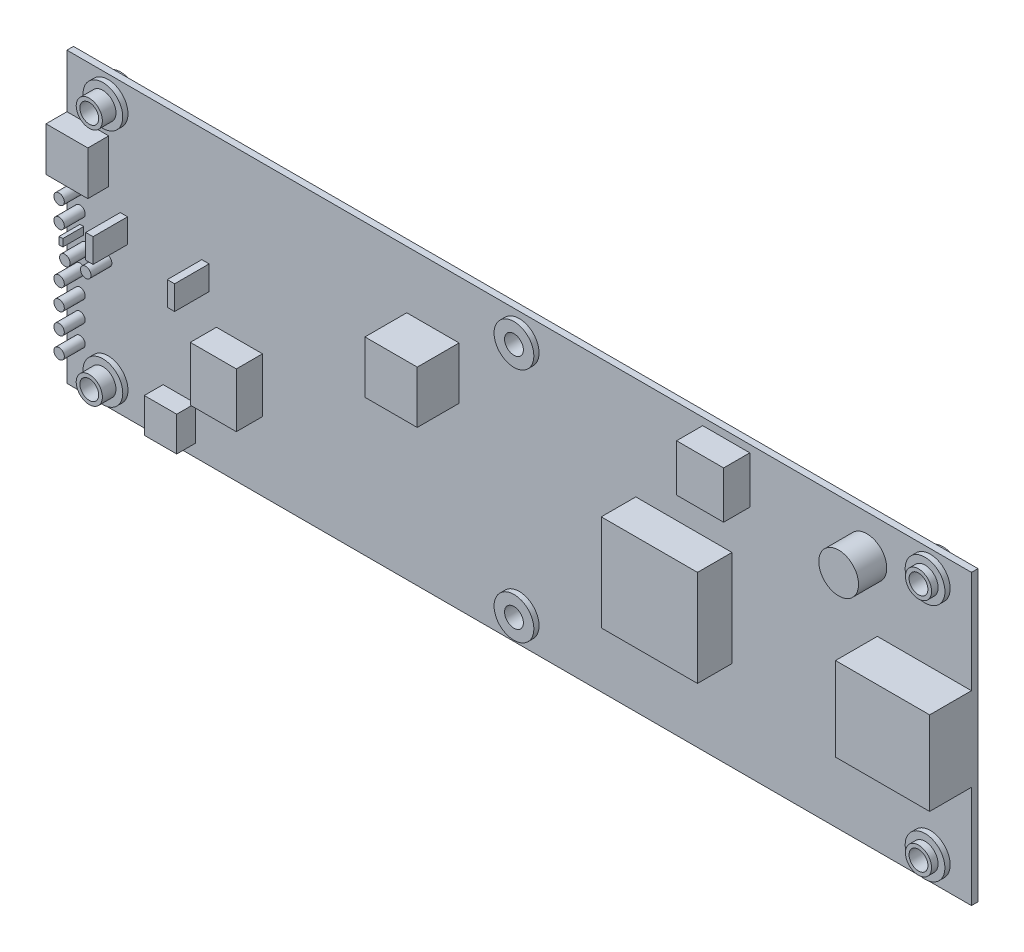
ISO-10303-21;
HEADER;
FILE_DESCRIPTION(('STEP AP214'),'2;1');
FILE_NAME('part.step','',(''),(''),'','','');
FILE_SCHEMA(('AUTOMOTIVE_DESIGN { 1 0 10303 214 1 1 1 1 }'));
ENDSEC;
DATA;
#1=APPLICATION_CONTEXT('core data for automotive mechanical design processes');
#2=APPLICATION_PROTOCOL_DEFINITION('international standard','automotive_design',2000,#1);
#3=PRODUCT_CONTEXT('',#1,'mechanical');
#4=PRODUCT('Part','Part','',(#3));
#5=PRODUCT_RELATED_PRODUCT_CATEGORY('part','',(#4));
#6=PRODUCT_DEFINITION_FORMATION('','',#4);
#7=PRODUCT_DEFINITION_CONTEXT('part definition',#1,'design');
#8=PRODUCT_DEFINITION('design','',#6,#7);
#9=PRODUCT_DEFINITION_SHAPE('','',#8);
#10=(LENGTH_UNIT() NAMED_UNIT(*) SI_UNIT(.MILLI.,.METRE.));
#11=(NAMED_UNIT(*) PLANE_ANGLE_UNIT() SI_UNIT($,.RADIAN.));
#12=(NAMED_UNIT(*) SI_UNIT($,.STERADIAN.) SOLID_ANGLE_UNIT());
#13=UNCERTAINTY_MEASURE_WITH_UNIT(LENGTH_MEASURE(1.E-05),#10,'distance_accuracy_value','');
#14=(GEOMETRIC_REPRESENTATION_CONTEXT(3) GLOBAL_UNCERTAINTY_ASSIGNED_CONTEXT((#13)) GLOBAL_UNIT_ASSIGNED_CONTEXT((#10,
#11,#12)) REPRESENTATION_CONTEXT('',''));
#15=CARTESIAN_POINT('',(0.,0.,0.));
#16=DIRECTION('',(0.,0.,1.));
#17=DIRECTION('',(1.,0.,0.));
#18=AXIS2_PLACEMENT_3D('',#15,#16,#17);
#19=CARTESIAN_POINT('',(0.,70.1039999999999,-1.38777878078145E-13));
#20=DIRECTION('',(0.,0.,-1.));
#21=DIRECTION('',(-1.,0.,0.));
#22=AXIS2_PLACEMENT_3D('',#19,#20,#21);
#23=PLANE('',#22);
#24=CARTESIAN_POINT('',(209.7024,5.99439999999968,-1.38777878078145E-13));
#25=DIRECTION('',(0.,0.,-1.));
#26=DIRECTION('',(-1.,0.,0.));
#27=AXIS2_PLACEMENT_3D('',#24,#25,#26);
#28=CIRCLE('',#27,4.82599999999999);
#29=CARTESIAN_POINT('',(204.8764,5.99439999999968,-1.38839285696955E-13));
#30=VERTEX_POINT('',#29);
#31=EDGE_CURVE('E1800',#30,#30,#28,.T.);
#32=ORIENTED_EDGE('',*,*,#31,.F.);
#33=EDGE_LOOP('',(#32));
#34=FACE_BOUND('',#33,.T.);
#35=CARTESIAN_POINT('',(109.855,6.34999999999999,0.));
#36=DIRECTION('',(0.,0.,-1.));
#37=DIRECTION('',(-1.,0.,0.));
#38=AXIS2_PLACEMENT_3D('',#35,#36,#37);
#39=CIRCLE('',#38,4.82599999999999);
#40=CARTESIAN_POINT('',(105.029,6.34999999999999,0.));
#41=VERTEX_POINT('',#40);
#42=EDGE_CURVE('E1809',#41,#41,#39,.T.);
#43=ORIENTED_EDGE('',*,*,#42,.F.);
#44=EDGE_LOOP('',(#43));
#45=FACE_BOUND('',#44,.T.);
#46=CARTESIAN_POINT('',(10.0076,64.1096000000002,0.));
#47=DIRECTION('',(0.,0.,-1.));
#48=DIRECTION('',(-1.,0.,0.));
#49=AXIS2_PLACEMENT_3D('',#46,#47,#48);
#50=CIRCLE('',#49,4.826);
#51=CARTESIAN_POINT('',(5.18159999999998,64.1096000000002,0.));
#52=VERTEX_POINT('',#51);
#53=EDGE_CURVE('E1099',#52,#52,#50,.T.);
#54=ORIENTED_EDGE('',*,*,#53,.F.);
#55=EDGE_LOOP('',(#54));
#56=FACE_BOUND('',#55,.T.);
#57=DIRECTION('',(0.,-1.,0.));
#58=VECTOR('',#57,1.);
#59=CARTESIAN_POINT('',(0.,0.,0.));
#60=LINE('',#59,#58);
#61=CARTESIAN_POINT('',(0.,70.1039999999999,-1.38777878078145E-13));
#62=VERTEX_POINT('',#61);
#63=CARTESIAN_POINT('',(0.,0.,0.));
#64=VERTEX_POINT('',#63);
#65=EDGE_CURVE('E659',#62,#64,#60,.T.);
#66=ORIENTED_EDGE('',*,*,#65,.F.);
#67=DIRECTION('',(-1.,0.,0.));
#68=VECTOR('',#67,1.);
#69=CARTESIAN_POINT('',(0.,70.1039999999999,-1.38777878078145E-13));
#70=LINE('',#69,#68);
#71=CARTESIAN_POINT('',(219.71,70.1040000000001,0.));
#72=VERTEX_POINT('',#71);
#73=EDGE_CURVE('E319',#72,#62,#70,.T.);
#74=ORIENTED_EDGE('',*,*,#73,.F.);
#75=DIRECTION('',(0.,1.,0.));
#76=VECTOR('',#75,1.);
#77=CARTESIAN_POINT('',(219.71,-1.11022302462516E-13,-1.11022302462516E-13));
#78=LINE('',#77,#76);
#79=CARTESIAN_POINT('',(219.71,-1.11022302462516E-13,-1.11022302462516E-13));
#80=VERTEX_POINT('',#79);
#81=EDGE_CURVE('E663',#80,#72,#78,.T.);
#82=ORIENTED_EDGE('',*,*,#81,.F.);
#83=DIRECTION('',(1.,0.,0.));
#84=VECTOR('',#83,1.);
#85=CARTESIAN_POINT('',(0.,0.,0.));
#86=LINE('',#85,#84);
#87=EDGE_CURVE('E661',#64,#80,#86,.T.);
#88=ORIENTED_EDGE('',*,*,#87,.F.);
#89=EDGE_LOOP('',(#66,#74,#82,#88));
#90=FACE_BOUND('',#89,.T.);
#91=CARTESIAN_POINT('',(10.0076,5.99439999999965,-1.52655665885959E-13));
#92=DIRECTION('',(0.,0.,-1.));
#93=DIRECTION('',(-1.,0.,0.));
#94=AXIS2_PLACEMENT_3D('',#91,#92,#93);
#95=CIRCLE('',#94,4.826);
#96=CARTESIAN_POINT('',(5.18159999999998,5.99439999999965,-1.5271707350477E-13));
#97=VERTEX_POINT('',#96);
#98=EDGE_CURVE('E1106',#97,#97,#95,.T.);
#99=ORIENTED_EDGE('',*,*,#98,.F.);
#100=EDGE_LOOP('',(#99));
#101=FACE_BOUND('',#100,.T.);
#102=CARTESIAN_POINT('',(109.855,63.7539999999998,0.));
#103=DIRECTION('',(0.,0.,-1.));
#104=DIRECTION('',(-1.,0.,0.));
#105=AXIS2_PLACEMENT_3D('',#102,#103,#104);
#106=CIRCLE('',#105,4.82599999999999);
#107=CARTESIAN_POINT('',(105.029,63.7539999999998,0.));
#108=VERTEX_POINT('',#107);
#109=EDGE_CURVE('E1793',#108,#108,#106,.T.);
#110=ORIENTED_EDGE('',*,*,#109,.F.);
#111=EDGE_LOOP('',(#110));
#112=FACE_BOUND('',#111,.T.);
#113=CARTESIAN_POINT('',(209.7024,64.1095999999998,0.));
#114=DIRECTION('',(0.,0.,-1.));
#115=DIRECTION('',(-1.,0.,0.));
#116=AXIS2_PLACEMENT_3D('',#113,#114,#115);
#117=CIRCLE('',#116,4.82599999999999);
#118=CARTESIAN_POINT('',(204.8764,64.1095999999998,0.));
#119=VERTEX_POINT('',#118);
#120=EDGE_CURVE('E1825',#119,#119,#117,.T.);
#121=ORIENTED_EDGE('',*,*,#120,.F.);
#122=EDGE_LOOP('',(#121));
#123=FACE_BOUND('',#122,.T.);
#124=ADVANCED_FACE('F30',(#34,#45,#56,#90,#101,#112,#123),#23,.T.);
#125=CARTESIAN_POINT('',(209.7024,64.1095999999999,2.85749999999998));
#126=DIRECTION('',(0.,0.,1.));
#127=DIRECTION('',(1.,0.,0.));
#128=AXIS2_PLACEMENT_3D('',#125,#126,#127);
#129=PLANE('',#128);
#130=CARTESIAN_POINT('',(209.7024,64.1095999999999,2.85749999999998));
#131=DIRECTION('',(0.,0.,1.));
#132=DIRECTION('',(1.,0.,0.));
#133=AXIS2_PLACEMENT_3D('',#130,#131,#132);
#134=CIRCLE('',#133,4.82599999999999);
#135=CARTESIAN_POINT('',(214.5284,64.1095999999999,2.85749999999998));
#136=VERTEX_POINT('',#135);
#137=EDGE_CURVE('E327',#136,#136,#134,.T.);
#138=ORIENTED_EDGE('',*,*,#137,.T.);
#139=EDGE_LOOP('',(#138));
#140=FACE_BOUND('',#139,.T.);
#141=CARTESIAN_POINT('',(209.7024,64.1095999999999,2.85749999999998));
#142=DIRECTION('',(0.,0.,1.));
#143=DIRECTION('',(1.,0.,0.));
#144=AXIS2_PLACEMENT_3D('',#141,#142,#143);
#145=CIRCLE('',#144,3.175);
#146=CARTESIAN_POINT('',(212.8774,64.1095999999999,2.85749999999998));
#147=VERTEX_POINT('',#146);
#148=EDGE_CURVE('E1115',#147,#147,#145,.T.);
#149=ORIENTED_EDGE('',*,*,#148,.F.);
#150=EDGE_LOOP('',(#149));
#151=FACE_BOUND('',#150,.T.);
#152=ADVANCED_FACE('F750',(#140,#151),#129,.T.);
#153=CARTESIAN_POINT('',(209.7024,5.99439999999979,2.85749999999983));
#154=DIRECTION('',(0.,0.,-1.));
#155=DIRECTION('',(-1.,0.,0.));
#156=AXIS2_PLACEMENT_3D('',#153,#154,#155);
#157=PLANE('',#156);
#158=CARTESIAN_POINT('',(209.7024,5.99439999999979,2.85749999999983));
#159=DIRECTION('',(0.,0.,1.));
#160=DIRECTION('',(-1.,0.,0.));
#161=AXIS2_PLACEMENT_3D('',#158,#159,#160);
#162=CIRCLE('',#161,4.82599999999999);
#163=CARTESIAN_POINT('',(204.8764,5.99439999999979,2.85749999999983));
#164=VERTEX_POINT('',#163);
#165=EDGE_CURVE('E1140',#164,#164,#162,.T.);
#166=ORIENTED_EDGE('',*,*,#165,.T.);
#167=EDGE_LOOP('',(#166));
#168=FACE_BOUND('',#167,.T.);
#169=CARTESIAN_POINT('',(209.7024,5.99439999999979,2.85749999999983));
#170=DIRECTION('',(0.,0.,-1.));
#171=DIRECTION('',(-1.,0.,0.));
#172=AXIS2_PLACEMENT_3D('',#169,#170,#171);
#173=CIRCLE('',#172,3.175);
#174=CARTESIAN_POINT('',(206.5274,5.99439999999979,2.85749999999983));
#175=VERTEX_POINT('',#174);
#176=EDGE_CURVE('E11',#175,#175,#173,.F.);
#177=ORIENTED_EDGE('',*,*,#176,.F.);
#178=EDGE_LOOP('',(#177));
#179=FACE_BOUND('',#178,.T.);
#180=ADVANCED_FACE('F743',(#168,#179),#157,.F.);
#181=CARTESIAN_POINT('',(10.0076,5.99439999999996,2.85749999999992));
#182=DIRECTION('',(0.,0.,1.));
#183=DIRECTION('',(1.,0.,0.));
#184=AXIS2_PLACEMENT_3D('',#181,#182,#183);
#185=PLANE('',#184);
#186=CARTESIAN_POINT('',(10.0076,5.99439999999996,2.85749999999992));
#187=DIRECTION('',(0.,0.,1.));
#188=DIRECTION('',(1.,0.,0.));
#189=AXIS2_PLACEMENT_3D('',#186,#187,#188);
#190=CIRCLE('',#189,4.82599999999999);
#191=CARTESIAN_POINT('',(14.8336,5.99439999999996,2.85749999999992));
#192=VERTEX_POINT('',#191);
#193=EDGE_CURVE('E1143',#192,#192,#190,.T.);
#194=ORIENTED_EDGE('',*,*,#193,.T.);
#195=EDGE_LOOP('',(#194));
#196=FACE_BOUND('',#195,.T.);
#197=CARTESIAN_POINT('',(10.0076,5.99439999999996,2.85749999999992));
#198=DIRECTION('',(0.,0.,1.));
#199=DIRECTION('',(1.,0.,0.));
#200=AXIS2_PLACEMENT_3D('',#197,#198,#199);
#201=CIRCLE('',#200,3.175);
#202=CARTESIAN_POINT('',(13.1826,5.99439999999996,2.85749999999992));
#203=VERTEX_POINT('',#202);
#204=EDGE_CURVE('E1130',#203,#203,#201,.T.);
#205=ORIENTED_EDGE('',*,*,#204,.F.);
#206=EDGE_LOOP('',(#205));
#207=FACE_BOUND('',#206,.T.);
#208=ADVANCED_FACE('F734',(#196,#207),#185,.T.);
#209=CARTESIAN_POINT('',(10.0076,64.1096000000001,2.85750000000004));
#210=DIRECTION('',(0.,0.,-1.));
#211=DIRECTION('',(-1.,0.,0.));
#212=AXIS2_PLACEMENT_3D('',#209,#210,#211);
#213=PLANE('',#212);
#214=CARTESIAN_POINT('',(10.0076,64.1096000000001,2.85750000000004));
#215=DIRECTION('',(0.,0.,1.));
#216=DIRECTION('',(-1.,0.,0.));
#217=AXIS2_PLACEMENT_3D('',#214,#215,#216);
#218=CIRCLE('',#217,4.82599999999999);
#219=CARTESIAN_POINT('',(5.18159999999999,64.1096000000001,2.85750000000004));
#220=VERTEX_POINT('',#219);
#221=EDGE_CURVE('E1158',#220,#220,#218,.T.);
#222=ORIENTED_EDGE('',*,*,#221,.T.);
#223=EDGE_LOOP('',(#222));
#224=FACE_BOUND('',#223,.T.);
#225=CARTESIAN_POINT('',(10.0076,64.1096000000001,2.85750000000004));
#226=DIRECTION('',(0.,0.,-1.));
#227=DIRECTION('',(-1.,0.,0.));
#228=AXIS2_PLACEMENT_3D('',#225,#226,#227);
#229=CIRCLE('',#228,3.175);
#230=CARTESIAN_POINT('',(6.83259999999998,64.1096000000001,2.85750000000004));
#231=VERTEX_POINT('',#230);
#232=EDGE_CURVE('E38',#231,#231,#229,.F.);
#233=ORIENTED_EDGE('',*,*,#232,.F.);
#234=EDGE_LOOP('',(#233));
#235=FACE_BOUND('',#234,.T.);
#236=ADVANCED_FACE('F732',(#224,#235),#213,.F.);
#237=CARTESIAN_POINT('',(0.,70.1039999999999,1.58749999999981));
#238=DIRECTION('',(0.,0.,-1.));
#239=DIRECTION('',(-1.,0.,0.));
#240=AXIS2_PLACEMENT_3D('',#237,#238,#239);
#241=PLANE('',#240);
#242=CARTESIAN_POINT('',(10.0076,5.99439999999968,1.58749999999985));
#243=DIRECTION('',(0.,0.,-1.));
#244=DIRECTION('',(-1.,0.,0.));
#245=AXIS2_PLACEMENT_3D('',#242,#243,#244);
#246=CIRCLE('',#245,4.82599999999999);
#247=CARTESIAN_POINT('',(5.18159999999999,5.99439999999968,1.58749999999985));
#248=VERTEX_POINT('',#247);
#249=EDGE_CURVE('E722',#248,#248,#246,.F.);
#250=ORIENTED_EDGE('',*,*,#249,.F.);
#251=EDGE_LOOP('',(#250));
#252=FACE_BOUND('',#251,.T.);
#253=CARTESIAN_POINT('',(109.855,63.7539999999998,1.58749999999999));
#254=DIRECTION('',(0.,0.,-1.));
#255=DIRECTION('',(-1.,0.,0.));
#256=AXIS2_PLACEMENT_3D('',#253,#254,#255);
#257=CIRCLE('',#256,4.82599999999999);
#258=CARTESIAN_POINT('',(105.029,63.7539999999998,1.58749999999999));
#259=VERTEX_POINT('',#258);
#260=EDGE_CURVE('E716',#259,#259,#257,.F.);
#261=ORIENTED_EDGE('',*,*,#260,.F.);
#262=EDGE_LOOP('',(#261));
#263=FACE_BOUND('',#262,.T.);
#264=CARTESIAN_POINT('',(209.7024,64.1095999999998,1.58749999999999));
#265=DIRECTION('',(0.,0.,-1.));
#266=DIRECTION('',(-1.,0.,0.));
#267=AXIS2_PLACEMENT_3D('',#264,#265,#266);
#268=CIRCLE('',#267,4.82599999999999);
#269=CARTESIAN_POINT('',(204.8764,64.1095999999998,1.58749999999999));
#270=VERTEX_POINT('',#269);
#271=EDGE_CURVE('E710',#270,#270,#268,.F.);
#272=ORIENTED_EDGE('',*,*,#271,.F.);
#273=EDGE_LOOP('',(#272));
#274=FACE_BOUND('',#273,.T.);
#275=DIRECTION('',(0.,-1.,0.));
#276=VECTOR('',#275,1.);
#277=CARTESIAN_POINT('',(3.17500000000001,35.0519999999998,1.58749999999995));
#278=LINE('',#277,#276);
#279=CARTESIAN_POINT('',(3.17500000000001,35.0519999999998,1.58749999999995));
#280=VERTEX_POINT('',#279);
#281=CARTESIAN_POINT('',(3.17500000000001,33.2627992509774,1.58749999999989));
#282=VERTEX_POINT('',#281);
#283=EDGE_CURVE('E332',#280,#282,#278,.T.);
#284=ORIENTED_EDGE('',*,*,#283,.F.);
#285=DIRECTION('',(-1.,0.,0.));
#286=VECTOR('',#285,1.);
#287=CARTESIAN_POINT('',(3.17500000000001,35.0519999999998,1.58749999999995));
#288=LINE('',#287,#286);
#289=CARTESIAN_POINT('',(4.08665620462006,35.0519999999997,1.58749999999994));
#290=VERTEX_POINT('',#289);
#291=EDGE_CURVE('E347',#290,#280,#288,.T.);
#292=ORIENTED_EDGE('',*,*,#291,.F.);
#293=DIRECTION('',(0.,1.,0.));
#294=VECTOR('',#293,1.);
#295=CARTESIAN_POINT('',(4.08665620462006,35.0519999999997,1.58749999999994));
#296=LINE('',#295,#294);
#297=CARTESIAN_POINT('',(4.08665620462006,33.2627992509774,1.58749999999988));
#298=VERTEX_POINT('',#297);
#299=EDGE_CURVE('E344',#298,#290,#296,.T.);
#300=ORIENTED_EDGE('',*,*,#299,.F.);
#301=DIRECTION('',(1.,0.,0.));
#302=VECTOR('',#301,1.);
#303=CARTESIAN_POINT('',(3.17500000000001,33.2627992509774,1.58749999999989));
#304=LINE('',#303,#302);
#305=EDGE_CURVE('E336',#282,#298,#304,.T.);
#306=ORIENTED_EDGE('',*,*,#305,.F.);
#307=EDGE_LOOP('',(#284,#292,#300,#306));
#308=FACE_BOUND('',#307,.T.);
#309=CARTESIAN_POINT('',(4.57200000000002,30.7339999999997,1.58749999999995));
#310=DIRECTION('',(0.,0.,-1.));
#311=DIRECTION('',(-1.,0.,0.));
#312=AXIS2_PLACEMENT_3D('',#309,#310,#311);
#313=CIRCLE('',#312,1.27);
#314=CARTESIAN_POINT('',(3.30200000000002,30.7339999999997,1.58749999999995));
#315=VERTEX_POINT('',#314);
#316=EDGE_CURVE('E704',#315,#315,#313,.F.);
#317=ORIENTED_EDGE('',*,*,#316,.F.);
#318=EDGE_LOOP('',(#317));
#319=FACE_BOUND('',#318,.T.);
#320=CARTESIAN_POINT('',(3.17500000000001,15.4939999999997,1.58750000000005));
#321=DIRECTION('',(0.,0.,-1.));
#322=DIRECTION('',(-1.,0.,0.));
#323=AXIS2_PLACEMENT_3D('',#320,#321,#322);
#324=CIRCLE('',#323,1.27);
#325=CARTESIAN_POINT('',(1.90500000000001,15.4939999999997,1.58750000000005));
#326=VERTEX_POINT('',#325);
#327=EDGE_CURVE('E698',#326,#326,#324,.F.);
#328=ORIENTED_EDGE('',*,*,#327,.F.);
#329=EDGE_LOOP('',(#328));
#330=FACE_BOUND('',#329,.T.);
#331=CARTESIAN_POINT('',(3.17500000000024,25.6539999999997,1.58749999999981));
#332=DIRECTION('',(0.,0.,-1.));
#333=DIRECTION('',(-1.,0.,0.));
#334=AXIS2_PLACEMENT_3D('',#331,#332,#333);
#335=CIRCLE('',#334,1.27);
#336=CARTESIAN_POINT('',(1.90500000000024,25.6539999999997,1.58749999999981));
#337=VERTEX_POINT('',#336);
#338=EDGE_CURVE('E692',#337,#337,#335,.F.);
#339=ORIENTED_EDGE('',*,*,#338,.F.);
#340=EDGE_LOOP('',(#339));
#341=FACE_BOUND('',#340,.T.);
#342=CARTESIAN_POINT('',(3.17500000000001,42.9259999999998,1.58749999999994));
#343=DIRECTION('',(0.,0.,-1.));
#344=DIRECTION('',(-1.,0.,0.));
#345=AXIS2_PLACEMENT_3D('',#342,#343,#344);
#346=CIRCLE('',#345,1.27);
#347=CARTESIAN_POINT('',(1.90500000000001,42.9259999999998,1.58749999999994));
#348=VERTEX_POINT('',#347);
#349=EDGE_CURVE('E686',#348,#348,#346,.F.);
#350=ORIENTED_EDGE('',*,*,#349,.F.);
#351=EDGE_LOOP('',(#350));
#352=FACE_BOUND('',#351,.T.);
#353=DIRECTION('',(0.,-1.,0.));
#354=VECTOR('',#353,1.);
#355=CARTESIAN_POINT('',(36.322,29.9719999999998,1.58749999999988));
#356=LINE('',#355,#354);
#357=CARTESIAN_POINT('',(36.322,29.9719999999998,1.58749999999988));
#358=VERTEX_POINT('',#357);
#359=CARTESIAN_POINT('',(36.322,16.7639999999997,1.58749999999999));
#360=VERTEX_POINT('',#359);
#361=EDGE_CURVE('E398',#358,#360,#356,.T.);
#362=ORIENTED_EDGE('',*,*,#361,.F.);
#363=DIRECTION('',(-1.,0.,0.));
#364=VECTOR('',#363,1.);
#365=CARTESIAN_POINT('',(36.322,29.9719999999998,1.58749999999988));
#366=LINE('',#365,#364);
#367=CARTESIAN_POINT('',(47.498,29.9719999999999,1.58749999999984));
#368=VERTEX_POINT('',#367);
#369=EDGE_CURVE('E407',#368,#358,#366,.T.);
#370=ORIENTED_EDGE('',*,*,#369,.F.);
#371=DIRECTION('',(0.,1.,0.));
#372=VECTOR('',#371,1.);
#373=CARTESIAN_POINT('',(47.498,29.9719999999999,1.58749999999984));
#374=LINE('',#373,#372);
#375=CARTESIAN_POINT('',(47.498,16.7639999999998,1.58749999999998));
#376=VERTEX_POINT('',#375);
#377=EDGE_CURVE('E404',#376,#368,#374,.T.);
#378=ORIENTED_EDGE('',*,*,#377,.F.);
#379=DIRECTION('',(1.,0.,0.));
#380=VECTOR('',#379,1.);
#381=CARTESIAN_POINT('',(36.322,16.7639999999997,1.58749999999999));
#382=LINE('',#381,#380);
#383=EDGE_CURVE('E401',#360,#376,#382,.T.);
#384=ORIENTED_EDGE('',*,*,#383,.F.);
#385=EDGE_LOOP('',(#362,#370,#378,#384));
#386=FACE_BOUND('',#385,.T.);
#387=DIRECTION('',(0.,-1.,0.));
#388=VECTOR('',#387,1.);
#389=CARTESIAN_POINT('',(12.954,42.4179999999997,1.58749999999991));
#390=LINE('',#389,#388);
#391=CARTESIAN_POINT('',(12.954,42.4179999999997,1.58749999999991));
#392=VERTEX_POINT('',#391);
#393=CARTESIAN_POINT('',(12.954,36.5759999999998,1.58749999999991));
#394=VERTEX_POINT('',#393);
#395=EDGE_CURVE('E464',#392,#394,#390,.T.);
#396=ORIENTED_EDGE('',*,*,#395,.F.);
#397=DIRECTION('',(-1.,0.,0.));
#398=VECTOR('',#397,1.);
#399=CARTESIAN_POINT('',(12.954,42.4179999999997,1.58749999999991));
#400=LINE('',#399,#398);
#401=CARTESIAN_POINT('',(14.732,42.4179999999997,1.58749999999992));
#402=VERTEX_POINT('',#401);
#403=EDGE_CURVE('E473',#402,#392,#400,.T.);
#404=ORIENTED_EDGE('',*,*,#403,.F.);
#405=DIRECTION('',(0.,1.,0.));
#406=VECTOR('',#405,1.);
#407=CARTESIAN_POINT('',(14.732,42.4179999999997,1.58749999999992));
#408=LINE('',#407,#406);
#409=CARTESIAN_POINT('',(14.732,36.5759999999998,1.58749999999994));
#410=VERTEX_POINT('',#409);
#411=EDGE_CURVE('E470',#410,#402,#408,.T.);
#412=ORIENTED_EDGE('',*,*,#411,.F.);
#413=DIRECTION('',(1.,0.,0.));
#414=VECTOR('',#413,1.);
#415=CARTESIAN_POINT('',(12.954,36.5759999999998,1.58749999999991));
#416=LINE('',#415,#414);
#417=EDGE_CURVE('E467',#394,#410,#416,.T.);
#418=ORIENTED_EDGE('',*,*,#417,.F.);
#419=EDGE_LOOP('',(#396,#404,#412,#418));
#420=FACE_BOUND('',#419,.T.);
#421=DIRECTION('',(0.,-1.,0.));
#422=VECTOR('',#421,1.);
#423=CARTESIAN_POINT('',(154.432,68.3260000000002,1.58750000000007));
#424=LINE('',#423,#422);
#425=CARTESIAN_POINT('',(154.432,68.3260000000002,1.58750000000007));
#426=VERTEX_POINT('',#425);
#427=CARTESIAN_POINT('',(154.432,56.896,1.58749999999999));
#428=VERTEX_POINT('',#427);
#429=EDGE_CURVE('E530',#426,#428,#424,.T.);
#430=ORIENTED_EDGE('',*,*,#429,.F.);
#431=DIRECTION('',(-1.,0.,0.));
#432=VECTOR('',#431,1.);
#433=CARTESIAN_POINT('',(154.432,68.3260000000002,1.58750000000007));
#434=LINE('',#433,#432);
#435=CARTESIAN_POINT('',(165.862,68.3259999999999,1.58750000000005));
#436=VERTEX_POINT('',#435);
#437=EDGE_CURVE('E539',#436,#426,#434,.T.);
#438=ORIENTED_EDGE('',*,*,#437,.F.);
#439=DIRECTION('',(0.,1.,0.));
#440=VECTOR('',#439,1.);
#441=CARTESIAN_POINT('',(165.862,68.3259999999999,1.58750000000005));
#442=LINE('',#441,#440);
#443=CARTESIAN_POINT('',(165.862,56.896,1.58749999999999));
#444=VERTEX_POINT('',#443);
#445=EDGE_CURVE('E536',#444,#436,#442,.T.);
#446=ORIENTED_EDGE('',*,*,#445,.F.);
#447=DIRECTION('',(1.,0.,0.));
#448=VECTOR('',#447,1.);
#449=CARTESIAN_POINT('',(154.432,56.896,1.58749999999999));
#450=LINE('',#449,#448);
#451=EDGE_CURVE('E533',#428,#444,#450,.T.);
#452=ORIENTED_EDGE('',*,*,#451,.F.);
#453=EDGE_LOOP('',(#430,#438,#446,#452));
#454=FACE_BOUND('',#453,.T.);
#455=DIRECTION('',(0.,1.,0.));
#456=VECTOR('',#455,1.);
#457=CARTESIAN_POINT('',(95.25,43.4339999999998,1.58750000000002));
#458=LINE('',#457,#456);
#459=CARTESIAN_POINT('',(95.25,43.4339999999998,1.58750000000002));
#460=VERTEX_POINT('',#459);
#461=CARTESIAN_POINT('',(95.25,56.134,1.58749999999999));
#462=VERTEX_POINT('',#461);
#463=EDGE_CURVE('E626',#460,#462,#458,.T.);
#464=ORIENTED_EDGE('',*,*,#463,.F.);
#465=DIRECTION('',(1.,0.,0.));
#466=VECTOR('',#465,1.);
#467=CARTESIAN_POINT('',(95.25,43.4339999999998,1.58750000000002));
#468=LINE('',#467,#466);
#469=CARTESIAN_POINT('',(82.55,43.4339999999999,1.58750000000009));
#470=VERTEX_POINT('',#469);
#471=EDGE_CURVE('E635',#470,#460,#468,.T.);
#472=ORIENTED_EDGE('',*,*,#471,.F.);
#473=DIRECTION('',(0.,-1.,0.));
#474=VECTOR('',#473,1.);
#475=CARTESIAN_POINT('',(82.55,43.4339999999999,1.58750000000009));
#476=LINE('',#475,#474);
#477=CARTESIAN_POINT('',(82.55,56.134,1.58749999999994));
#478=VERTEX_POINT('',#477);
#479=EDGE_CURVE('E632',#478,#470,#476,.T.);
#480=ORIENTED_EDGE('',*,*,#479,.F.);
#481=DIRECTION('',(-1.,0.,0.));
#482=VECTOR('',#481,1.);
#483=CARTESIAN_POINT('',(95.25,56.134,1.58749999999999));
#484=LINE('',#483,#482);
#485=EDGE_CURVE('E629',#462,#478,#484,.T.);
#486=ORIENTED_EDGE('',*,*,#485,.F.);
#487=EDGE_LOOP('',(#464,#472,#480,#486));
#488=FACE_BOUND('',#487,.T.);
#489=DIRECTION('',(0.,-1.,0.));
#490=VECTOR('',#489,1.);
#491=CARTESIAN_POINT('',(138.176,45.2119999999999,1.58749999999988));
#492=LINE('',#491,#490);
#493=CARTESIAN_POINT('',(138.176,45.2119999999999,1.58749999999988));
#494=VERTEX_POINT('',#493);
#495=CARTESIAN_POINT('',(138.176,21.8439999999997,1.58749999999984));
#496=VERTEX_POINT('',#495);
#497=EDGE_CURVE('E563',#494,#496,#492,.T.);
#498=ORIENTED_EDGE('',*,*,#497,.F.);
#499=DIRECTION('',(-1.,0.,0.));
#500=VECTOR('',#499,1.);
#501=CARTESIAN_POINT('',(138.176,45.2119999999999,1.58749999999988));
#502=LINE('',#501,#500);
#503=CARTESIAN_POINT('',(161.544,45.212,1.58749999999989));
#504=VERTEX_POINT('',#503);
#505=EDGE_CURVE('E572',#504,#494,#502,.T.);
#506=ORIENTED_EDGE('',*,*,#505,.F.);
#507=DIRECTION('',(0.,1.,0.));
#508=VECTOR('',#507,1.);
#509=CARTESIAN_POINT('',(161.544,45.212,1.58749999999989));
#510=LINE('',#509,#508);
#511=CARTESIAN_POINT('',(161.544,21.8439999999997,1.58749999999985));
#512=VERTEX_POINT('',#511);
#513=EDGE_CURVE('E569',#512,#504,#510,.T.);
#514=ORIENTED_EDGE('',*,*,#513,.F.);
#515=DIRECTION('',(1.,0.,0.));
#516=VECTOR('',#515,1.);
#517=CARTESIAN_POINT('',(138.176,21.8439999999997,1.58749999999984));
#518=LINE('',#517,#516);
#519=EDGE_CURVE('E566',#496,#512,#518,.T.);
#520=ORIENTED_EDGE('',*,*,#519,.F.);
#521=EDGE_LOOP('',(#498,#506,#514,#520));
#522=FACE_BOUND('',#521,.T.);
#523=DIRECTION('',(0.,-1.,0.));
#524=VECTOR('',#523,1.);
#525=CARTESIAN_POINT('',(23.368,3.04799999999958,1.58749999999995));
#526=LINE('',#525,#524);
#527=CARTESIAN_POINT('',(23.368,11.4299999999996,1.58749999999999));
#528=VERTEX_POINT('',#527);
#529=CARTESIAN_POINT('',(23.368,3.04799999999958,1.58749999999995));
#530=VERTEX_POINT('',#529);
#531=EDGE_CURVE('E497',#528,#530,#526,.T.);
#532=ORIENTED_EDGE('',*,*,#531,.F.);
#533=DIRECTION('',(-1.,0.,0.));
#534=VECTOR('',#533,1.);
#535=CARTESIAN_POINT('',(23.368,11.4299999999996,1.58749999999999));
#536=LINE('',#535,#534);
#537=CARTESIAN_POINT('',(31.242,11.43,1.58750000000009));
#538=VERTEX_POINT('',#537);
#539=EDGE_CURVE('E506',#538,#528,#536,.T.);
#540=ORIENTED_EDGE('',*,*,#539,.F.);
#541=DIRECTION('',(0.,1.,0.));
#542=VECTOR('',#541,1.);
#543=CARTESIAN_POINT('',(31.242,3.04799999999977,1.58749999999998));
#544=LINE('',#543,#542);
#545=CARTESIAN_POINT('',(31.242,3.04799999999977,1.58749999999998));
#546=VERTEX_POINT('',#545);
#547=EDGE_CURVE('E503',#546,#538,#544,.T.);
#548=ORIENTED_EDGE('',*,*,#547,.F.);
#549=DIRECTION('',(1.,0.,0.));
#550=VECTOR('',#549,1.);
#551=CARTESIAN_POINT('',(23.368,3.04799999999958,1.58749999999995));
#552=LINE('',#551,#550);
#553=EDGE_CURVE('E500',#530,#546,#552,.T.);
#554=ORIENTED_EDGE('',*,*,#553,.F.);
#555=EDGE_LOOP('',(#532,#540,#548,#554));
#556=FACE_BOUND('',#555,.T.);
#557=DIRECTION('',(0.,-1.,0.));
#558=VECTOR('',#557,1.);
#559=CARTESIAN_POINT('',(32.766,42.4179999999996,1.58749999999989));
#560=LINE('',#559,#558);
#561=CARTESIAN_POINT('',(32.766,42.4179999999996,1.58749999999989));
#562=VERTEX_POINT('',#561);
#563=CARTESIAN_POINT('',(32.766,36.5759999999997,1.58749999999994));
#564=VERTEX_POINT('',#563);
#565=EDGE_CURVE('E431',#562,#564,#560,.T.);
#566=ORIENTED_EDGE('',*,*,#565,.F.);
#567=DIRECTION('',(-1.,0.,0.));
#568=VECTOR('',#567,1.);
#569=CARTESIAN_POINT('',(32.766,42.4179999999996,1.58749999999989));
#570=LINE('',#569,#568);
#571=CARTESIAN_POINT('',(34.544,42.4179999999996,1.58749999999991));
#572=VERTEX_POINT('',#571);
#573=EDGE_CURVE('E440',#572,#562,#570,.T.);
#574=ORIENTED_EDGE('',*,*,#573,.F.);
#575=DIRECTION('',(0.,1.,0.));
#576=VECTOR('',#575,1.);
#577=CARTESIAN_POINT('',(34.544,42.4179999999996,1.58749999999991));
#578=LINE('',#577,#576);
#579=CARTESIAN_POINT('',(34.544,36.5759999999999,1.58749999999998));
#580=VERTEX_POINT('',#579);
#581=EDGE_CURVE('E437',#580,#572,#578,.T.);
#582=ORIENTED_EDGE('',*,*,#581,.F.);
#583=DIRECTION('',(1.,0.,0.));
#584=VECTOR('',#583,1.);
#585=CARTESIAN_POINT('',(32.766,36.5759999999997,1.58749999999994));
#586=LINE('',#585,#584);
#587=EDGE_CURVE('E434',#564,#580,#586,.T.);
#588=ORIENTED_EDGE('',*,*,#587,.F.);
#589=EDGE_LOOP('',(#566,#574,#582,#588));
#590=FACE_BOUND('',#589,.T.);
#591=CARTESIAN_POINT('',(194.31,60.7060000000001,1.58750000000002));
#592=DIRECTION('',(0.,0.,-1.));
#593=DIRECTION('',(-1.,0.,0.));
#594=AXIS2_PLACEMENT_3D('',#591,#592,#593);
#595=CIRCLE('',#594,4.82599999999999);
#596=CARTESIAN_POINT('',(189.484,60.7060000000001,1.58750000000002));
#597=VERTEX_POINT('',#596);
#598=EDGE_CURVE('E683',#597,#597,#595,.F.);
#599=ORIENTED_EDGE('',*,*,#598,.F.);
#600=EDGE_LOOP('',(#599));
#601=FACE_BOUND('',#600,.T.);
#602=CARTESIAN_POINT('',(3.17500000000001,37.8459999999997,1.58749999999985));
#603=DIRECTION('',(0.,0.,-1.));
#604=DIRECTION('',(-1.,0.,0.));
#605=AXIS2_PLACEMENT_3D('',#602,#603,#604);
#606=CIRCLE('',#605,1.27);
#607=CARTESIAN_POINT('',(1.90500000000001,37.8459999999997,1.58749999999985));
#608=VERTEX_POINT('',#607);
#609=EDGE_CURVE('E689',#608,#608,#606,.F.);
#610=ORIENTED_EDGE('',*,*,#609,.F.);
#611=EDGE_LOOP('',(#610));
#612=FACE_BOUND('',#611,.T.);
#613=CARTESIAN_POINT('',(3.17500000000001,20.5739999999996,1.58749999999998));
#614=DIRECTION('',(0.,0.,-1.));
#615=DIRECTION('',(-1.,0.,0.));
#616=AXIS2_PLACEMENT_3D('',#613,#614,#615);
#617=CIRCLE('',#616,1.27);
#618=CARTESIAN_POINT('',(1.90500000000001,20.5739999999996,1.58749999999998));
#619=VERTEX_POINT('',#618);
#620=EDGE_CURVE('E695',#619,#619,#617,.F.);
#621=ORIENTED_EDGE('',*,*,#620,.F.);
#622=EDGE_LOOP('',(#621));
#623=FACE_BOUND('',#622,.T.);
#624=CARTESIAN_POINT('',(3.17500000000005,10.4139999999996,1.58749999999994));
#625=DIRECTION('',(0.,0.,-1.));
#626=DIRECTION('',(-1.,0.,0.));
#627=AXIS2_PLACEMENT_3D('',#624,#625,#626);
#628=CIRCLE('',#627,1.27);
#629=CARTESIAN_POINT('',(1.90500000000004,10.4139999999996,1.58749999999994));
#630=VERTEX_POINT('',#629);
#631=EDGE_CURVE('E701',#630,#630,#628,.F.);
#632=ORIENTED_EDGE('',*,*,#631,.F.);
#633=EDGE_LOOP('',(#632));
#634=FACE_BOUND('',#633,.T.);
#635=CARTESIAN_POINT('',(9.65199999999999,30.734,1.58749999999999));
#636=DIRECTION('',(0.,0.,-1.));
#637=DIRECTION('',(-1.,0.,0.));
#638=AXIS2_PLACEMENT_3D('',#635,#636,#637);
#639=CIRCLE('',#638,1.27);
#640=CARTESIAN_POINT('',(8.38199999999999,30.734,1.58749999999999));
#641=VERTEX_POINT('',#640);
#642=EDGE_CURVE('E707',#641,#641,#639,.F.);
#643=ORIENTED_EDGE('',*,*,#642,.F.);
#644=EDGE_LOOP('',(#643));
#645=FACE_BOUND('',#644,.T.);
#646=DIRECTION('',(1.,0.,0.));
#647=VECTOR('',#646,1.);
#648=CARTESIAN_POINT('',(0.,46.4819999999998,1.58749999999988));
#649=LINE('',#648,#647);
#650=CARTESIAN_POINT('',(0.,46.4819999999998,1.58749999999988));
#651=VERTEX_POINT('',#650);
#652=CARTESIAN_POINT('',(10.16,46.482,1.58749999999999));
#653=VERTEX_POINT('',#652);
#654=EDGE_CURVE('E321',#651,#653,#649,.T.);
#655=ORIENTED_EDGE('',*,*,#654,.F.);
#656=DIRECTION('',(0.,-1.,0.));
#657=VECTOR('',#656,1.);
#658=CARTESIAN_POINT('',(0.,-3.60822483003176E-13,1.58749999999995));
#659=LINE('',#658,#657);
#660=CARTESIAN_POINT('',(0.,-3.60822483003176E-13,1.58749999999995));
#661=VERTEX_POINT('',#660);
#662=EDGE_CURVE('E310',#651,#661,#659,.T.);
#663=ORIENTED_EDGE('',*,*,#662,.T.);
#664=DIRECTION('',(1.,0.,0.));
#665=VECTOR('',#664,1.);
#666=CARTESIAN_POINT('',(0.,-3.60822483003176E-13,1.58749999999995));
#667=LINE('',#666,#665);
#668=CARTESIAN_POINT('',(219.71,-3.60822483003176E-13,1.58750000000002));
#669=VERTEX_POINT('',#668);
#670=EDGE_CURVE('E666',#661,#669,#667,.T.);
#671=ORIENTED_EDGE('',*,*,#670,.T.);
#672=DIRECTION('',(0.,1.,0.));
#673=VECTOR('',#672,1.);
#674=CARTESIAN_POINT('',(219.71,-3.60822483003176E-13,1.58750000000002));
#675=LINE('',#674,#673);
#676=CARTESIAN_POINT('',(219.71,24.892,1.58750000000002));
#677=VERTEX_POINT('',#676);
#678=EDGE_CURVE('E669',#669,#677,#675,.T.);
#679=ORIENTED_EDGE('',*,*,#678,.T.);
#680=DIRECTION('',(1.,0.,0.));
#681=VECTOR('',#680,1.);
#682=CARTESIAN_POINT('',(219.71,24.892,1.58750000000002));
#683=LINE('',#682,#681);
#684=CARTESIAN_POINT('',(196.85,24.892,1.58750000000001));
#685=VERTEX_POINT('',#684);
#686=EDGE_CURVE('E602',#685,#677,#683,.T.);
#687=ORIENTED_EDGE('',*,*,#686,.F.);
#688=DIRECTION('',(0.,-1.,0.));
#689=VECTOR('',#688,1.);
#690=CARTESIAN_POINT('',(196.85,45.212,1.58749999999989));
#691=LINE('',#690,#689);
#692=CARTESIAN_POINT('',(196.85,45.212,1.58749999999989));
#693=VERTEX_POINT('',#692);
#694=EDGE_CURVE('E599',#693,#685,#691,.T.);
#695=ORIENTED_EDGE('',*,*,#694,.F.);
#696=DIRECTION('',(-1.,0.,0.));
#697=VECTOR('',#696,1.);
#698=CARTESIAN_POINT('',(219.71,45.212,1.58749999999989));
#699=LINE('',#698,#697);
#700=CARTESIAN_POINT('',(219.71,45.212,1.58749999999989));
#701=VERTEX_POINT('',#700);
#702=EDGE_CURVE('E596',#701,#693,#699,.T.);
#703=ORIENTED_EDGE('',*,*,#702,.F.);
#704=CARTESIAN_POINT('',(219.71,70.1040000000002,1.58749999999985));
#705=VERTEX_POINT('',#704);
#706=EDGE_CURVE('E668',#701,#705,#675,.T.);
#707=ORIENTED_EDGE('',*,*,#706,.T.);
#708=DIRECTION('',(-1.,0.,0.));
#709=VECTOR('',#708,1.);
#710=CARTESIAN_POINT('',(0.,70.1039999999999,1.58749999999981));
#711=LINE('',#710,#709);
#712=CARTESIAN_POINT('',(0.,70.1039999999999,1.58749999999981));
#713=VERTEX_POINT('',#712);
#714=EDGE_CURVE('E671',#705,#713,#711,.T.);
#715=ORIENTED_EDGE('',*,*,#714,.T.);
#716=CARTESIAN_POINT('',(0.,57.1499999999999,1.58749999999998));
#717=VERTEX_POINT('',#716);
#718=EDGE_CURVE('E318',#713,#717,#659,.T.);
#719=ORIENTED_EDGE('',*,*,#718,.T.);
#720=DIRECTION('',(-1.,0.,0.));
#721=VECTOR('',#720,1.);
#722=CARTESIAN_POINT('',(0.,57.1499999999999,1.58749999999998));
#723=LINE('',#722,#721);
#724=CARTESIAN_POINT('',(10.16,57.1499999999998,1.58749999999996));
#725=VERTEX_POINT('',#724);
#726=EDGE_CURVE('E50',#725,#717,#723,.T.);
#727=ORIENTED_EDGE('',*,*,#726,.F.);
#728=DIRECTION('',(0.,1.,0.));
#729=VECTOR('',#728,1.);
#730=CARTESIAN_POINT('',(10.16,57.1499999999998,1.58749999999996));
#731=LINE('',#730,#729);
#732=EDGE_CURVE('E45',#653,#725,#731,.T.);
#733=ORIENTED_EDGE('',*,*,#732,.F.);
#734=EDGE_LOOP('',(#655,#663,#671,#679,#687,#695,#703,#707,#715,#719,#727,#733));
#735=FACE_BOUND('',#734,.T.);
#736=CARTESIAN_POINT('',(10.0076,64.1096,1.58750000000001));
#737=DIRECTION('',(0.,0.,-1.));
#738=DIRECTION('',(-1.,0.,0.));
#739=AXIS2_PLACEMENT_3D('',#736,#737,#738);
#740=CIRCLE('',#739,4.82599999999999);
#741=CARTESIAN_POINT('',(5.18159999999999,64.1096,1.58750000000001));
#742=VERTEX_POINT('',#741);
#743=EDGE_CURVE('E713',#742,#742,#740,.F.);
#744=ORIENTED_EDGE('',*,*,#743,.F.);
#745=EDGE_LOOP('',(#744));
#746=FACE_BOUND('',#745,.T.);
#747=CARTESIAN_POINT('',(109.855,6.34999999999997,1.58749999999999));
#748=DIRECTION('',(0.,0.,-1.));
#749=DIRECTION('',(-1.,0.,0.));
#750=AXIS2_PLACEMENT_3D('',#747,#748,#749);
#751=CIRCLE('',#750,4.82599999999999);
#752=CARTESIAN_POINT('',(105.029,6.34999999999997,1.58749999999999));
#753=VERTEX_POINT('',#752);
#754=EDGE_CURVE('E719',#753,#753,#751,.F.);
#755=ORIENTED_EDGE('',*,*,#754,.F.);
#756=EDGE_LOOP('',(#755));
#757=FACE_BOUND('',#756,.T.);
#758=CARTESIAN_POINT('',(209.7024,5.99439999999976,1.58749999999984));
#759=DIRECTION('',(0.,0.,-1.));
#760=DIRECTION('',(-1.,0.,0.));
#761=AXIS2_PLACEMENT_3D('',#758,#759,#760);
#762=CIRCLE('',#761,4.82599999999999);
#763=CARTESIAN_POINT('',(204.8764,5.99439999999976,1.58749999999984));
#764=VERTEX_POINT('',#763);
#765=EDGE_CURVE('E725',#764,#764,#762,.F.);
#766=ORIENTED_EDGE('',*,*,#765,.F.);
#767=EDGE_LOOP('',(#766));
#768=FACE_BOUND('',#767,.T.);
#769=ADVANCED_FACE('F322',(#252,#263,#274,#308,#319,#330,#341,#352,#386,#420,#454,#488,#522,
#556,#590,#601,#612,#623,#634,#645,#735,#746,#757,#768),#241,.F.);
#770=CARTESIAN_POINT('',(0.,-3.60822483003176E-13,1.58749999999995));
#771=DIRECTION('',(1.,0.,0.));
#772=DIRECTION('',(0.,0.,-1.));
#773=AXIS2_PLACEMENT_3D('',#770,#771,#772);
#774=PLANE('',#773);
#775=ORIENTED_EDGE('',*,*,#65,.T.);
#776=DIRECTION('',(0.,0.,-1.));
#777=VECTOR('',#776,1.);
#778=CARTESIAN_POINT('',(0.,-3.60822483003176E-13,1.58749999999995));
#779=LINE('',#778,#777);
#780=EDGE_CURVE('E316',#661,#64,#779,.T.);
#781=ORIENTED_EDGE('',*,*,#780,.F.);
#782=ORIENTED_EDGE('',*,*,#662,.F.);
#783=DIRECTION('',(0.,0.,-1.));
#784=VECTOR('',#783,1.);
#785=CARTESIAN_POINT('',(2.22044604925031E-13,46.4819999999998,6.66749999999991));
#786=LINE('',#785,#784);
#787=CARTESIAN_POINT('',(2.22044604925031E-13,46.4819999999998,6.66749999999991));
#788=VERTEX_POINT('',#787);
#789=EDGE_CURVE('E314',#788,#651,#786,.T.);
#790=ORIENTED_EDGE('',*,*,#789,.F.);
#791=DIRECTION('',(0.,-1.,0.));
#792=VECTOR('',#791,1.);
#793=CARTESIAN_POINT('',(0.,57.1499999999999,6.66749999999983));
#794=LINE('',#793,#792);
#795=CARTESIAN_POINT('',(0.,57.1499999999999,6.66749999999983));
#796=VERTEX_POINT('',#795);
#797=EDGE_CURVE('E796',#796,#788,#794,.T.);
#798=ORIENTED_EDGE('',*,*,#797,.F.);
#799=DIRECTION('',(0.,0.,-1.));
#800=VECTOR('',#799,1.);
#801=CARTESIAN_POINT('',(0.,57.1499999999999,6.66749999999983));
#802=LINE('',#801,#800);
#803=EDGE_CURVE('E790',#796,#717,#802,.T.);
#804=ORIENTED_EDGE('',*,*,#803,.T.);
#805=ORIENTED_EDGE('',*,*,#718,.F.);
#806=DIRECTION('',(0.,0.,-1.));
#807=VECTOR('',#806,1.);
#808=CARTESIAN_POINT('',(0.,70.1039999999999,1.58749999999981));
#809=LINE('',#808,#807);
#810=EDGE_CURVE('E673',#713,#62,#809,.T.);
#811=ORIENTED_EDGE('',*,*,#810,.T.);
#812=EDGE_LOOP('',(#775,#781,#782,#790,#798,#804,#805,#811));
#813=FACE_BOUND('',#812,.T.);
#814=ADVANCED_FACE('F32',(#813),#774,.F.);
#815=CARTESIAN_POINT('',(0.,-3.60822483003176E-13,1.58749999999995));
#816=DIRECTION('',(0.,1.,0.));
#817=DIRECTION('',(0.,0.,1.));
#818=AXIS2_PLACEMENT_3D('',#815,#816,#817);
#819=PLANE('',#818);
#820=ORIENTED_EDGE('',*,*,#87,.T.);
#821=DIRECTION('',(0.,0.,-1.));
#822=VECTOR('',#821,1.);
#823=CARTESIAN_POINT('',(219.71,-3.60822483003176E-13,1.58750000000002));
#824=LINE('',#823,#822);
#825=EDGE_CURVE('E679',#669,#80,#824,.T.);
#826=ORIENTED_EDGE('',*,*,#825,.F.);
#827=ORIENTED_EDGE('',*,*,#670,.F.);
#828=ORIENTED_EDGE('',*,*,#780,.T.);
#829=EDGE_LOOP('',(#820,#826,#827,#828));
#830=FACE_BOUND('',#829,.T.);
#831=ADVANCED_FACE('F770',(#830),#819,.F.);
#832=CARTESIAN_POINT('',(219.71,-3.60822483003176E-13,1.58750000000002));
#833=DIRECTION('',(-1.,0.,0.));
#834=DIRECTION('',(0.,0.,1.));
#835=AXIS2_PLACEMENT_3D('',#832,#833,#834);
#836=PLANE('',#835);
#837=ORIENTED_EDGE('',*,*,#81,.T.);
#838=DIRECTION('',(0.,0.,-1.));
#839=VECTOR('',#838,1.);
#840=CARTESIAN_POINT('',(219.71,70.1040000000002,1.58749999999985));
#841=LINE('',#840,#839);
#842=EDGE_CURVE('E676',#705,#72,#841,.T.);
#843=ORIENTED_EDGE('',*,*,#842,.F.);
#844=ORIENTED_EDGE('',*,*,#706,.F.);
#845=DIRECTION('',(0.,0.,-1.));
#846=VECTOR('',#845,1.);
#847=CARTESIAN_POINT('',(219.71,45.2119999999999,11.7474999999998));
#848=LINE('',#847,#846);
#849=CARTESIAN_POINT('',(219.71,45.2119999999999,11.7474999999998));
#850=VERTEX_POINT('',#849);
#851=EDGE_CURVE('E623',#850,#701,#848,.T.);
#852=ORIENTED_EDGE('',*,*,#851,.F.);
#853=DIRECTION('',(0.,1.,0.));
#854=VECTOR('',#853,1.);
#855=CARTESIAN_POINT('',(219.71,45.2119999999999,11.7474999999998));
#856=LINE('',#855,#854);
#857=CARTESIAN_POINT('',(219.71,24.8919999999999,11.7474999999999));
#858=VERTEX_POINT('',#857);
#859=EDGE_CURVE('E605',#858,#850,#856,.T.);
#860=ORIENTED_EDGE('',*,*,#859,.F.);
#861=DIRECTION('',(0.,0.,-1.));
#862=VECTOR('',#861,1.);
#863=CARTESIAN_POINT('',(219.71,24.8919999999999,11.7474999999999));
#864=LINE('',#863,#862);
#865=EDGE_CURVE('E614',#858,#677,#864,.T.);
#866=ORIENTED_EDGE('',*,*,#865,.T.);
#867=ORIENTED_EDGE('',*,*,#678,.F.);
#868=ORIENTED_EDGE('',*,*,#825,.T.);
#869=EDGE_LOOP('',(#837,#843,#844,#852,#860,#866,#867,#868));
#870=FACE_BOUND('',#869,.T.);
#871=ADVANCED_FACE('F767',(#870),#836,.F.);
#872=CARTESIAN_POINT('',(0.,70.1039999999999,1.58749999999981));
#873=DIRECTION('',(0.,-1.,0.));
#874=DIRECTION('',(0.,0.,-1.));
#875=AXIS2_PLACEMENT_3D('',#872,#873,#874);
#876=PLANE('',#875);
#877=ORIENTED_EDGE('',*,*,#73,.T.);
#878=ORIENTED_EDGE('',*,*,#810,.F.);
#879=ORIENTED_EDGE('',*,*,#714,.F.);
#880=ORIENTED_EDGE('',*,*,#842,.T.);
#881=EDGE_LOOP('',(#877,#878,#879,#880));
#882=FACE_BOUND('',#881,.T.);
#883=ADVANCED_FACE('F764',(#882),#876,.F.);
#884=CARTESIAN_POINT('',(209.7024,64.1095999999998,0.));
#885=DIRECTION('',(0.,0.,1.));
#886=DIRECTION('',(1.,0.,0.));
#887=AXIS2_PLACEMENT_3D('',#884,#885,#886);
#888=CYLINDRICAL_SURFACE('',#887,2.28600000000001);
#889=CARTESIAN_POINT('',(209.7024,64.1095999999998,4.445));
#890=DIRECTION('',(0.,0.,1.));
#891=DIRECTION('',(1.,0.,0.));
#892=AXIS2_PLACEMENT_3D('',#889,#890,#891);
#893=CIRCLE('',#892,2.28600000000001);
#894=CARTESIAN_POINT('',(211.9884,64.1095999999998,4.445));
#895=VERTEX_POINT('',#894);
#896=EDGE_CURVE('E1112',#895,#895,#893,.T.);
#897=ORIENTED_EDGE('',*,*,#896,.T.);
#898=EDGE_LOOP('',(#897));
#899=FACE_BOUND('',#898,.T.);
#900=CARTESIAN_POINT('',(209.7024,64.1095999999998,-1.52400000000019));
#901=DIRECTION('',(0.,0.,-1.));
#902=DIRECTION('',(-1.,0.,0.));
#903=AXIS2_PLACEMENT_3D('',#900,#901,#902);
#904=CIRCLE('',#903,2.28600000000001);
#905=CARTESIAN_POINT('',(207.4164,64.1095999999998,-1.52400000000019));
#906=VERTEX_POINT('',#905);
#907=EDGE_CURVE('E1827',#906,#906,#904,.T.);
#908=ORIENTED_EDGE('',*,*,#907,.T.);
#909=EDGE_LOOP('',(#908));
#910=FACE_BOUND('',#909,.T.);
#911=ADVANCED_FACE('F761',(#899,#910),#888,.F.);
#912=CARTESIAN_POINT('',(10.0076,64.1096000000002,0.));
#913=DIRECTION('',(0.,0.,1.));
#914=DIRECTION('',(1.,0.,0.));
#915=AXIS2_PLACEMENT_3D('',#912,#913,#914);
#916=CYLINDRICAL_SURFACE('',#915,2.28600000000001);
#917=CARTESIAN_POINT('',(10.0076,64.1096000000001,6.15949999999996));
#918=DIRECTION('',(0.,0.,1.));
#919=DIRECTION('',(1.,0.,0.));
#920=AXIS2_PLACEMENT_3D('',#917,#918,#919);
#921=CIRCLE('',#920,2.28600000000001);
#922=CARTESIAN_POINT('',(12.2936,64.1096000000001,6.15949999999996));
#923=VERTEX_POINT('',#922);
#924=EDGE_CURVE('E1094',#923,#923,#921,.T.);
#925=ORIENTED_EDGE('',*,*,#924,.T.);
#926=EDGE_LOOP('',(#925));
#927=FACE_BOUND('',#926,.T.);
#928=CARTESIAN_POINT('',(10.0076,64.1095999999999,-1.52400000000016));
#929=DIRECTION('',(0.,0.,-1.));
#930=DIRECTION('',(-1.,0.,0.));
#931=AXIS2_PLACEMENT_3D('',#928,#929,#930);
#932=CIRCLE('',#931,2.28600000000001);
#933=CARTESIAN_POINT('',(7.72159999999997,64.1095999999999,-1.52400000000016));
#934=VERTEX_POINT('',#933);
#935=EDGE_CURVE('E1097',#934,#934,#932,.T.);
#936=ORIENTED_EDGE('',*,*,#935,.T.);
#937=EDGE_LOOP('',(#936));
#938=FACE_BOUND('',#937,.T.);
#939=ADVANCED_FACE('F1083',(#927,#938),#916,.F.);
#940=CARTESIAN_POINT('',(109.855,63.7539999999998,0.));
#941=DIRECTION('',(0.,0.,1.));
#942=DIRECTION('',(1.,0.,0.));
#943=AXIS2_PLACEMENT_3D('',#940,#941,#942);
#944=CYLINDRICAL_SURFACE('',#943,2.28599999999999);
#945=CARTESIAN_POINT('',(109.855,63.7539999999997,2.85749999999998));
#946=DIRECTION('',(0.,0.,1.));
#947=DIRECTION('',(1.,0.,0.));
#948=AXIS2_PLACEMENT_3D('',#945,#946,#947);
#949=CIRCLE('',#948,2.28599999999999);
#950=CARTESIAN_POINT('',(112.141,63.7539999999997,2.85749999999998));
#951=VERTEX_POINT('',#950);
#952=EDGE_CURVE('E1152',#951,#951,#949,.T.);
#953=ORIENTED_EDGE('',*,*,#952,.T.);
#954=EDGE_LOOP('',(#953));
#955=FACE_BOUND('',#954,.T.);
#956=CARTESIAN_POINT('',(109.855,63.7539999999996,-1.52400000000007));
#957=DIRECTION('',(0.,0.,-1.));
#958=DIRECTION('',(-1.,0.,0.));
#959=AXIS2_PLACEMENT_3D('',#956,#957,#958);
#960=CIRCLE('',#959,2.28600000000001);
#961=CARTESIAN_POINT('',(107.569,63.7539999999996,-1.52400000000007));
#962=VERTEX_POINT('',#961);
#963=EDGE_CURVE('E1791',#962,#962,#960,.T.);
#964=ORIENTED_EDGE('',*,*,#963,.T.);
#965=EDGE_LOOP('',(#964));
#966=FACE_BOUND('',#965,.T.);
#967=ADVANCED_FACE('F1080',(#955,#966),#944,.F.);
#968=CARTESIAN_POINT('',(209.7024,5.99439999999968,-1.38777878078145E-13));
#969=DIRECTION('',(0.,0.,1.));
#970=DIRECTION('',(1.,0.,0.));
#971=AXIS2_PLACEMENT_3D('',#968,#969,#970);
#972=CYLINDRICAL_SURFACE('',#971,2.28600000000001);
#973=CARTESIAN_POINT('',(209.7024,5.99439999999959,4.44499999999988));
#974=DIRECTION('',(0.,0.,1.));
#975=DIRECTION('',(1.,0.,0.));
#976=AXIS2_PLACEMENT_3D('',#973,#974,#975);
#977=CIRCLE('',#976,2.28600000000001);
#978=CARTESIAN_POINT('',(211.9884,5.99439999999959,4.44499999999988));
#979=VERTEX_POINT('',#978);
#980=EDGE_CURVE('E1121',#979,#979,#977,.T.);
#981=ORIENTED_EDGE('',*,*,#980,.T.);
#982=EDGE_LOOP('',(#981));
#983=FACE_BOUND('',#982,.T.);
#984=CARTESIAN_POINT('',(209.7024,5.99439999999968,-1.52400000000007));
#985=DIRECTION('',(0.,0.,-1.));
#986=DIRECTION('',(-1.,0.,0.));
#987=AXIS2_PLACEMENT_3D('',#984,#985,#986);
#988=CIRCLE('',#987,2.28600000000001);
#989=CARTESIAN_POINT('',(207.4164,5.99439999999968,-1.52400000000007));
#990=VERTEX_POINT('',#989);
#991=EDGE_CURVE('E1830',#990,#990,#988,.T.);
#992=ORIENTED_EDGE('',*,*,#991,.T.);
#993=EDGE_LOOP('',(#992));
#994=FACE_BOUND('',#993,.T.);
#995=ADVANCED_FACE('F1076',(#983,#994),#972,.F.);
#996=CARTESIAN_POINT('',(109.855,6.34999999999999,0.));
#997=DIRECTION('',(0.,0.,1.));
#998=DIRECTION('',(1.,0.,0.));
#999=AXIS2_PLACEMENT_3D('',#996,#997,#998);
#1000=CYLINDRICAL_SURFACE('',#999,2.28599999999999);
#1001=CARTESIAN_POINT('',(109.855,6.34999999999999,2.85749999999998));
#1002=DIRECTION('',(0.,0.,1.));
#1003=DIRECTION('',(-1.,0.,0.));
#1004=AXIS2_PLACEMENT_3D('',#1001,#1002,#1003);
#1005=CIRCLE('',#1004,2.28599999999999);
#1006=CARTESIAN_POINT('',(107.569,6.34999999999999,2.85749999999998));
#1007=VERTEX_POINT('',#1006);
#1008=EDGE_CURVE('E1146',#1007,#1007,#1005,.T.);
#1009=ORIENTED_EDGE('',*,*,#1008,.T.);
#1010=EDGE_LOOP('',(#1009));
#1011=FACE_BOUND('',#1010,.T.);
#1012=CARTESIAN_POINT('',(109.855,6.34999999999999,-1.524));
#1013=DIRECTION('',(0.,0.,-1.));
#1014=DIRECTION('',(-1.,0.,0.));
#1015=AXIS2_PLACEMENT_3D('',#1012,#1013,#1014);
#1016=CIRCLE('',#1015,2.28599999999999);
#1017=CARTESIAN_POINT('',(107.569,6.34999999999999,-1.524));
#1018=VERTEX_POINT('',#1017);
#1019=EDGE_CURVE('E1806',#1018,#1018,#1016,.T.);
#1020=ORIENTED_EDGE('',*,*,#1019,.T.);
#1021=EDGE_LOOP('',(#1020));
#1022=FACE_BOUND('',#1021,.T.);
#1023=ADVANCED_FACE('F1072',(#1011,#1022),#1000,.F.);
#1024=CARTESIAN_POINT('',(10.0076,5.99439999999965,-1.52655665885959E-13));
#1025=DIRECTION('',(0.,0.,1.));
#1026=DIRECTION('',(1.,0.,0.));
#1027=AXIS2_PLACEMENT_3D('',#1024,#1025,#1026);
#1028=CYLINDRICAL_SURFACE('',#1027,2.28600000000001);
#1029=CARTESIAN_POINT('',(10.0076,5.99439999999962,6.15949999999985));
#1030=DIRECTION('',(0.,0.,1.));
#1031=DIRECTION('',(1.,0.,0.));
#1032=AXIS2_PLACEMENT_3D('',#1029,#1030,#1031);
#1033=CIRCLE('',#1032,2.28600000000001);
#1034=CARTESIAN_POINT('',(12.2936,5.99439999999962,6.15949999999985));
#1035=VERTEX_POINT('',#1034);
#1036=EDGE_CURVE('E1127',#1035,#1035,#1033,.T.);
#1037=ORIENTED_EDGE('',*,*,#1036,.T.);
#1038=EDGE_LOOP('',(#1037));
#1039=FACE_BOUND('',#1038,.T.);
#1040=CARTESIAN_POINT('',(10.0076,5.99439999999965,-1.52400000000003));
#1041=DIRECTION('',(0.,0.,-1.));
#1042=DIRECTION('',(-1.,0.,0.));
#1043=AXIS2_PLACEMENT_3D('',#1040,#1041,#1042);
#1044=CIRCLE('',#1043,2.28600000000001);
#1045=CARTESIAN_POINT('',(7.72159999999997,5.99439999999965,-1.52400000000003));
#1046=VERTEX_POINT('',#1045);
#1047=EDGE_CURVE('E1815',#1046,#1046,#1044,.T.);
#1048=ORIENTED_EDGE('',*,*,#1047,.T.);
#1049=EDGE_LOOP('',(#1048));
#1050=FACE_BOUND('',#1049,.T.);
#1051=ADVANCED_FACE('F1068',(#1039,#1050),#1028,.F.);
#1052=CARTESIAN_POINT('',(95.2500000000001,43.4339999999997,11.7475));
#1053=DIRECTION('',(-1.,0.,0.));
#1054=DIRECTION('',(0.,0.,1.));
#1055=AXIS2_PLACEMENT_3D('',#1052,#1053,#1054);
#1056=PLANE('',#1055);
#1057=ORIENTED_EDGE('',*,*,#463,.T.);
#1058=DIRECTION('',(0.,0.,-1.));
#1059=VECTOR('',#1058,1.);
#1060=CARTESIAN_POINT('',(95.25,56.1339999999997,11.7474999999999));
#1061=LINE('',#1060,#1059);
#1062=CARTESIAN_POINT('',(95.25,56.1339999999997,11.7474999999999));
#1063=VERTEX_POINT('',#1062);
#1064=EDGE_CURVE('E656',#1063,#462,#1061,.T.);
#1065=ORIENTED_EDGE('',*,*,#1064,.F.);
#1066=DIRECTION('',(0.,1.,0.));
#1067=VECTOR('',#1066,1.);
#1068=CARTESIAN_POINT('',(95.2500000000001,43.4339999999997,11.7475));
#1069=LINE('',#1068,#1067);
#1070=CARTESIAN_POINT('',(95.2500000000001,43.4339999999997,11.7475));
#1071=VERTEX_POINT('',#1070);
#1072=EDGE_CURVE('E638',#1071,#1063,#1069,.T.);
#1073=ORIENTED_EDGE('',*,*,#1072,.F.);
#1074=DIRECTION('',(0.,0.,-1.));
#1075=VECTOR('',#1074,1.);
#1076=CARTESIAN_POINT('',(95.2500000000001,43.4339999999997,11.7475));
#1077=LINE('',#1076,#1075);
#1078=EDGE_CURVE('E647',#1071,#460,#1077,.T.);
#1079=ORIENTED_EDGE('',*,*,#1078,.T.);
#1080=EDGE_LOOP('',(#1057,#1065,#1073,#1079));
#1081=FACE_BOUND('',#1080,.T.);
#1082=ADVANCED_FACE('F1064',(#1081),#1056,.F.);
#1083=CARTESIAN_POINT('',(95.25,56.1339999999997,11.7474999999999));
#1084=DIRECTION('',(0.,-1.,0.));
#1085=DIRECTION('',(0.,0.,-1.));
#1086=AXIS2_PLACEMENT_3D('',#1083,#1084,#1085);
#1087=PLANE('',#1086);
#1088=ORIENTED_EDGE('',*,*,#485,.T.);
#1089=DIRECTION('',(0.,0.,-1.));
#1090=VECTOR('',#1089,1.);
#1091=CARTESIAN_POINT('',(82.55,56.1339999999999,11.7475));
#1092=LINE('',#1091,#1090);
#1093=CARTESIAN_POINT('',(82.55,56.1339999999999,11.7475));
#1094=VERTEX_POINT('',#1093);
#1095=EDGE_CURVE('E653',#1094,#478,#1092,.T.);
#1096=ORIENTED_EDGE('',*,*,#1095,.F.);
#1097=DIRECTION('',(-1.,0.,0.));
#1098=VECTOR('',#1097,1.);
#1099=CARTESIAN_POINT('',(95.25,56.1339999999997,11.7474999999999));
#1100=LINE('',#1099,#1098);
#1101=EDGE_CURVE('E641',#1063,#1094,#1100,.T.);
#1102=ORIENTED_EDGE('',*,*,#1101,.F.);
#1103=ORIENTED_EDGE('',*,*,#1064,.T.);
#1104=EDGE_LOOP('',(#1088,#1096,#1102,#1103));
#1105=FACE_BOUND('',#1104,.T.);
#1106=ADVANCED_FACE('F1060',(#1105),#1087,.F.);
#1107=CARTESIAN_POINT('',(82.55,43.4339999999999,11.7475));
#1108=DIRECTION('',(1.,0.,0.));
#1109=DIRECTION('',(0.,1.,0.));
#1110=AXIS2_PLACEMENT_3D('',#1107,#1108,#1109);
#1111=PLANE('',#1110);
#1112=ORIENTED_EDGE('',*,*,#479,.T.);
#1113=DIRECTION('',(0.,0.,-1.));
#1114=VECTOR('',#1113,1.);
#1115=CARTESIAN_POINT('',(82.55,43.4339999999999,11.7475));
#1116=LINE('',#1115,#1114);
#1117=CARTESIAN_POINT('',(82.55,43.4339999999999,11.7475));
#1118=VERTEX_POINT('',#1117);
#1119=EDGE_CURVE('E650',#1118,#470,#1116,.T.);
#1120=ORIENTED_EDGE('',*,*,#1119,.F.);
#1121=DIRECTION('',(0.,-1.,0.));
#1122=VECTOR('',#1121,1.);
#1123=CARTESIAN_POINT('',(82.55,43.4339999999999,11.7475));
#1124=LINE('',#1123,#1122);
#1125=EDGE_CURVE('E643',#1094,#1118,#1124,.T.);
#1126=ORIENTED_EDGE('',*,*,#1125,.F.);
#1127=ORIENTED_EDGE('',*,*,#1095,.T.);
#1128=EDGE_LOOP('',(#1112,#1120,#1126,#1127));
#1129=FACE_BOUND('',#1128,.T.);
#1130=ADVANCED_FACE('F1056',(#1129),#1111,.F.);
#1131=CARTESIAN_POINT('',(95.2500000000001,43.4339999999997,11.7475));
#1132=DIRECTION('',(0.,1.,0.));
#1133=DIRECTION('',(0.,0.,1.));
#1134=AXIS2_PLACEMENT_3D('',#1131,#1132,#1133);
#1135=PLANE('',#1134);
#1136=ORIENTED_EDGE('',*,*,#471,.T.);
#1137=ORIENTED_EDGE('',*,*,#1078,.F.);
#1138=DIRECTION('',(1.,0.,0.));
#1139=VECTOR('',#1138,1.);
#1140=CARTESIAN_POINT('',(95.2500000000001,43.4339999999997,11.7475));
#1141=LINE('',#1140,#1139);
#1142=EDGE_CURVE('E645',#1118,#1071,#1141,.T.);
#1143=ORIENTED_EDGE('',*,*,#1142,.F.);
#1144=ORIENTED_EDGE('',*,*,#1119,.T.);
#1145=EDGE_LOOP('',(#1136,#1137,#1143,#1144));
#1146=FACE_BOUND('',#1145,.T.);
#1147=ADVANCED_FACE('F1052',(#1146),#1135,.F.);
#1148=CARTESIAN_POINT('',(95.25,56.1339999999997,11.7474999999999));
#1149=DIRECTION('',(0.,0.,1.));
#1150=DIRECTION('',(1.,0.,0.));
#1151=AXIS2_PLACEMENT_3D('',#1148,#1149,#1150);
#1152=PLANE('',#1151);
#1153=ORIENTED_EDGE('',*,*,#1072,.T.);
#1154=ORIENTED_EDGE('',*,*,#1101,.T.);
#1155=ORIENTED_EDGE('',*,*,#1125,.T.);
#1156=ORIENTED_EDGE('',*,*,#1142,.T.);
#1157=EDGE_LOOP('',(#1153,#1154,#1155,#1156));
#1158=FACE_BOUND('',#1157,.T.);
#1159=ADVANCED_FACE('F1048',(#1158),#1152,.T.);
#1160=CARTESIAN_POINT('',(219.71,45.2119999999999,11.7474999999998));
#1161=DIRECTION('',(0.,-1.,0.));
#1162=DIRECTION('',(1.,0.,0.));
#1163=AXIS2_PLACEMENT_3D('',#1160,#1161,#1162);
#1164=PLANE('',#1163);
#1165=ORIENTED_EDGE('',*,*,#702,.T.);
#1166=DIRECTION('',(0.,0.,-1.));
#1167=VECTOR('',#1166,1.);
#1168=CARTESIAN_POINT('',(196.85,45.212,11.7474999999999));
#1169=LINE('',#1168,#1167);
#1170=CARTESIAN_POINT('',(196.85,45.212,11.7474999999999));
#1171=VERTEX_POINT('',#1170);
#1172=EDGE_CURVE('E620',#1171,#693,#1169,.T.);
#1173=ORIENTED_EDGE('',*,*,#1172,.F.);
#1174=DIRECTION('',(-1.,0.,0.));
#1175=VECTOR('',#1174,1.);
#1176=CARTESIAN_POINT('',(219.71,45.2119999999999,11.7474999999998));
#1177=LINE('',#1176,#1175);
#1178=EDGE_CURVE('E608',#850,#1171,#1177,.T.);
#1179=ORIENTED_EDGE('',*,*,#1178,.F.);
#1180=ORIENTED_EDGE('',*,*,#851,.T.);
#1181=EDGE_LOOP('',(#1165,#1173,#1179,#1180));
#1182=FACE_BOUND('',#1181,.T.);
#1183=ADVANCED_FACE('F1044',(#1182),#1164,.F.);
#1184=CARTESIAN_POINT('',(196.85,45.212,11.7474999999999));
#1185=DIRECTION('',(1.,0.,0.));
#1186=DIRECTION('',(0.,0.,-1.));
#1187=AXIS2_PLACEMENT_3D('',#1184,#1185,#1186);
#1188=PLANE('',#1187);
#1189=ORIENTED_EDGE('',*,*,#694,.T.);
#1190=DIRECTION('',(0.,0.,-1.));
#1191=VECTOR('',#1190,1.);
#1192=CARTESIAN_POINT('',(196.85,24.8919999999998,11.7474999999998));
#1193=LINE('',#1192,#1191);
#1194=CARTESIAN_POINT('',(196.85,24.8919999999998,11.7474999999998));
#1195=VERTEX_POINT('',#1194);
#1196=EDGE_CURVE('E617',#1195,#685,#1193,.T.);
#1197=ORIENTED_EDGE('',*,*,#1196,.F.);
#1198=DIRECTION('',(0.,-1.,0.));
#1199=VECTOR('',#1198,1.);
#1200=CARTESIAN_POINT('',(196.85,45.212,11.7474999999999));
#1201=LINE('',#1200,#1199);
#1202=EDGE_CURVE('E610',#1171,#1195,#1201,.T.);
#1203=ORIENTED_EDGE('',*,*,#1202,.F.);
#1204=ORIENTED_EDGE('',*,*,#1172,.T.);
#1205=EDGE_LOOP('',(#1189,#1197,#1203,#1204));
#1206=FACE_BOUND('',#1205,.T.);
#1207=ADVANCED_FACE('F1040',(#1206),#1188,.F.);
#1208=CARTESIAN_POINT('',(219.71,24.8919999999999,11.7474999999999));
#1209=DIRECTION('',(0.,1.,0.));
#1210=DIRECTION('',(0.,0.,1.));
#1211=AXIS2_PLACEMENT_3D('',#1208,#1209,#1210);
#1212=PLANE('',#1211);
#1213=ORIENTED_EDGE('',*,*,#686,.T.);
#1214=ORIENTED_EDGE('',*,*,#865,.F.);
#1215=DIRECTION('',(1.,0.,0.));
#1216=VECTOR('',#1215,1.);
#1217=CARTESIAN_POINT('',(219.71,24.8919999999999,11.7474999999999));
#1218=LINE('',#1217,#1216);
#1219=EDGE_CURVE('E612',#1195,#858,#1218,.T.);
#1220=ORIENTED_EDGE('',*,*,#1219,.F.);
#1221=ORIENTED_EDGE('',*,*,#1196,.T.);
#1222=EDGE_LOOP('',(#1213,#1214,#1220,#1221));
#1223=FACE_BOUND('',#1222,.T.);
#1224=ADVANCED_FACE('F1036',(#1223),#1212,.F.);
#1225=CARTESIAN_POINT('',(219.71,24.8919999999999,11.7474999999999));
#1226=DIRECTION('',(0.,0.,-1.));
#1227=DIRECTION('',(-1.,0.,0.));
#1228=AXIS2_PLACEMENT_3D('',#1225,#1226,#1227);
#1229=PLANE('',#1228);
#1230=ORIENTED_EDGE('',*,*,#859,.T.);
#1231=ORIENTED_EDGE('',*,*,#1178,.T.);
#1232=ORIENTED_EDGE('',*,*,#1202,.T.);
#1233=ORIENTED_EDGE('',*,*,#1219,.T.);
#1234=EDGE_LOOP('',(#1230,#1231,#1232,#1233));
#1235=FACE_BOUND('',#1234,.T.);
#1236=ADVANCED_FACE('F1032',(#1235),#1229,.F.);
#1237=CARTESIAN_POINT('',(138.176,45.212,9.96949999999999));
#1238=DIRECTION('',(1.,0.,0.));
#1239=DIRECTION('',(0.,0.,-1.));
#1240=AXIS2_PLACEMENT_3D('',#1237,#1238,#1239);
#1241=PLANE('',#1240);
#1242=ORIENTED_EDGE('',*,*,#497,.T.);
#1243=DIRECTION('',(0.,0.,-1.));
#1244=VECTOR('',#1243,1.);
#1245=CARTESIAN_POINT('',(138.176,21.8439999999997,9.96949999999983));
#1246=LINE('',#1245,#1244);
#1247=CARTESIAN_POINT('',(138.176,21.8439999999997,9.96949999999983));
#1248=VERTEX_POINT('',#1247);
#1249=EDGE_CURVE('E593',#1248,#496,#1246,.T.);
#1250=ORIENTED_EDGE('',*,*,#1249,.F.);
#1251=DIRECTION('',(0.,-1.,0.));
#1252=VECTOR('',#1251,1.);
#1253=CARTESIAN_POINT('',(138.176,45.212,9.96949999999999));
#1254=LINE('',#1253,#1252);
#1255=CARTESIAN_POINT('',(138.176,45.212,9.96949999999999));
#1256=VERTEX_POINT('',#1255);
#1257=EDGE_CURVE('E575',#1256,#1248,#1254,.T.);
#1258=ORIENTED_EDGE('',*,*,#1257,.F.);
#1259=DIRECTION('',(0.,0.,-1.));
#1260=VECTOR('',#1259,1.);
#1261=CARTESIAN_POINT('',(138.176,45.212,9.96949999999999));
#1262=LINE('',#1261,#1260);
#1263=EDGE_CURVE('E584',#1256,#494,#1262,.T.);
#1264=ORIENTED_EDGE('',*,*,#1263,.T.);
#1265=EDGE_LOOP('',(#1242,#1250,#1258,#1264));
#1266=FACE_BOUND('',#1265,.T.);
#1267=ADVANCED_FACE('F1028',(#1266),#1241,.F.);
#1268=CARTESIAN_POINT('',(138.176,21.8439999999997,9.96949999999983));
#1269=DIRECTION('',(0.,1.,0.));
#1270=DIRECTION('',(0.,0.,1.));
#1271=AXIS2_PLACEMENT_3D('',#1268,#1269,#1270);
#1272=PLANE('',#1271);
#1273=ORIENTED_EDGE('',*,*,#519,.T.);
#1274=DIRECTION('',(0.,0.,-1.));
#1275=VECTOR('',#1274,1.);
#1276=CARTESIAN_POINT('',(161.544,21.8439999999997,9.96949999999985));
#1277=LINE('',#1276,#1275);
#1278=CARTESIAN_POINT('',(161.544,21.8439999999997,9.96949999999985));
#1279=VERTEX_POINT('',#1278);
#1280=EDGE_CURVE('E590',#1279,#512,#1277,.T.);
#1281=ORIENTED_EDGE('',*,*,#1280,.F.);
#1282=DIRECTION('',(1.,0.,0.));
#1283=VECTOR('',#1282,1.);
#1284=CARTESIAN_POINT('',(138.176,21.8439999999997,9.96949999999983));
#1285=LINE('',#1284,#1283);
#1286=EDGE_CURVE('E578',#1248,#1279,#1285,.T.);
#1287=ORIENTED_EDGE('',*,*,#1286,.F.);
#1288=ORIENTED_EDGE('',*,*,#1249,.T.);
#1289=EDGE_LOOP('',(#1273,#1281,#1287,#1288));
#1290=FACE_BOUND('',#1289,.T.);
#1291=ADVANCED_FACE('F1024',(#1290),#1272,.F.);
#1292=CARTESIAN_POINT('',(161.544,45.212,9.96949999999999));
#1293=DIRECTION('',(-1.,0.,0.));
#1294=DIRECTION('',(0.,0.,1.));
#1295=AXIS2_PLACEMENT_3D('',#1292,#1293,#1294);
#1296=PLANE('',#1295);
#1297=ORIENTED_EDGE('',*,*,#513,.T.);
#1298=DIRECTION('',(0.,0.,-1.));
#1299=VECTOR('',#1298,1.);
#1300=CARTESIAN_POINT('',(161.544,45.212,9.96949999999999));
#1301=LINE('',#1300,#1299);
#1302=CARTESIAN_POINT('',(161.544,45.212,9.96949999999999));
#1303=VERTEX_POINT('',#1302);
#1304=EDGE_CURVE('E587',#1303,#504,#1301,.T.);
#1305=ORIENTED_EDGE('',*,*,#1304,.F.);
#1306=DIRECTION('',(0.,1.,0.));
#1307=VECTOR('',#1306,1.);
#1308=CARTESIAN_POINT('',(161.544,45.212,9.96949999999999));
#1309=LINE('',#1308,#1307);
#1310=EDGE_CURVE('E580',#1279,#1303,#1309,.T.);
#1311=ORIENTED_EDGE('',*,*,#1310,.F.);
#1312=ORIENTED_EDGE('',*,*,#1280,.T.);
#1313=EDGE_LOOP('',(#1297,#1305,#1311,#1312));
#1314=FACE_BOUND('',#1313,.T.);
#1315=ADVANCED_FACE('F1020',(#1314),#1296,.F.);
#1316=CARTESIAN_POINT('',(138.176,45.212,9.96949999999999));
#1317=DIRECTION('',(0.,-1.,0.));
#1318=DIRECTION('',(0.,0.,-1.));
#1319=AXIS2_PLACEMENT_3D('',#1316,#1317,#1318);
#1320=PLANE('',#1319);
#1321=ORIENTED_EDGE('',*,*,#505,.T.);
#1322=ORIENTED_EDGE('',*,*,#1263,.F.);
#1323=DIRECTION('',(-1.,0.,0.));
#1324=VECTOR('',#1323,1.);
#1325=CARTESIAN_POINT('',(138.176,45.212,9.96949999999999));
#1326=LINE('',#1325,#1324);
#1327=EDGE_CURVE('E582',#1303,#1256,#1326,.T.);
#1328=ORIENTED_EDGE('',*,*,#1327,.F.);
#1329=ORIENTED_EDGE('',*,*,#1304,.T.);
#1330=EDGE_LOOP('',(#1321,#1322,#1328,#1329));
#1331=FACE_BOUND('',#1330,.T.);
#1332=ADVANCED_FACE('F1016',(#1331),#1320,.F.);
#1333=CARTESIAN_POINT('',(138.176,21.8439999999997,9.96949999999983));
#1334=DIRECTION('',(0.,0.,1.));
#1335=DIRECTION('',(1.,0.,0.));
#1336=AXIS2_PLACEMENT_3D('',#1333,#1334,#1335);
#1337=PLANE('',#1336);
#1338=ORIENTED_EDGE('',*,*,#1257,.T.);
#1339=ORIENTED_EDGE('',*,*,#1286,.T.);
#1340=ORIENTED_EDGE('',*,*,#1310,.T.);
#1341=ORIENTED_EDGE('',*,*,#1327,.T.);
#1342=EDGE_LOOP('',(#1338,#1339,#1340,#1341));
#1343=FACE_BOUND('',#1342,.T.);
#1344=ADVANCED_FACE('F1012',(#1343),#1337,.T.);
#1345=CARTESIAN_POINT('',(154.432,68.326,7.9375000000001));
#1346=DIRECTION('',(1.,0.,0.));
#1347=DIRECTION('',(0.,0.,-1.));
#1348=AXIS2_PLACEMENT_3D('',#1345,#1346,#1347);
#1349=PLANE('',#1348);
#1350=ORIENTED_EDGE('',*,*,#429,.T.);
#1351=DIRECTION('',(0.,0.,-1.));
#1352=VECTOR('',#1351,1.);
#1353=CARTESIAN_POINT('',(154.432,56.896,7.9374999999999));
#1354=LINE('',#1353,#1352);
#1355=CARTESIAN_POINT('',(154.432,56.896,7.9374999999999));
#1356=VERTEX_POINT('',#1355);
#1357=EDGE_CURVE('E560',#1356,#428,#1354,.T.);
#1358=ORIENTED_EDGE('',*,*,#1357,.F.);
#1359=DIRECTION('',(0.,-1.,0.));
#1360=VECTOR('',#1359,1.);
#1361=CARTESIAN_POINT('',(154.432,68.326,7.9375000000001));
#1362=LINE('',#1361,#1360);
#1363=CARTESIAN_POINT('',(154.432,68.326,7.9375000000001));
#1364=VERTEX_POINT('',#1363);
#1365=EDGE_CURVE('E542',#1364,#1356,#1362,.T.);
#1366=ORIENTED_EDGE('',*,*,#1365,.F.);
#1367=DIRECTION('',(0.,0.,-1.));
#1368=VECTOR('',#1367,1.);
#1369=CARTESIAN_POINT('',(154.432,68.326,7.9375000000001));
#1370=LINE('',#1369,#1368);
#1371=EDGE_CURVE('E551',#1364,#426,#1370,.T.);
#1372=ORIENTED_EDGE('',*,*,#1371,.T.);
#1373=EDGE_LOOP('',(#1350,#1358,#1366,#1372));
#1374=FACE_BOUND('',#1373,.T.);
#1375=ADVANCED_FACE('F1008',(#1374),#1349,.F.);
#1376=CARTESIAN_POINT('',(154.432,56.896,7.9374999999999));
#1377=DIRECTION('',(0.,1.,0.));
#1378=DIRECTION('',(0.,0.,1.));
#1379=AXIS2_PLACEMENT_3D('',#1376,#1377,#1378);
#1380=PLANE('',#1379);
#1381=ORIENTED_EDGE('',*,*,#451,.T.);
#1382=DIRECTION('',(0.,0.,-1.));
#1383=VECTOR('',#1382,1.);
#1384=CARTESIAN_POINT('',(165.862,56.8959999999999,7.9374999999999));
#1385=LINE('',#1384,#1383);
#1386=CARTESIAN_POINT('',(165.862,56.8959999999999,7.9374999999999));
#1387=VERTEX_POINT('',#1386);
#1388=EDGE_CURVE('E557',#1387,#444,#1385,.T.);
#1389=ORIENTED_EDGE('',*,*,#1388,.F.);
#1390=DIRECTION('',(1.,0.,0.));
#1391=VECTOR('',#1390,1.);
#1392=CARTESIAN_POINT('',(154.432,56.896,7.9374999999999));
#1393=LINE('',#1392,#1391);
#1394=EDGE_CURVE('E545',#1356,#1387,#1393,.T.);
#1395=ORIENTED_EDGE('',*,*,#1394,.F.);
#1396=ORIENTED_EDGE('',*,*,#1357,.T.);
#1397=EDGE_LOOP('',(#1381,#1389,#1395,#1396));
#1398=FACE_BOUND('',#1397,.T.);
#1399=ADVANCED_FACE('F1004',(#1398),#1380,.F.);
#1400=CARTESIAN_POINT('',(165.862,68.3259999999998,7.93750000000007));
#1401=DIRECTION('',(-1.,0.,0.));
#1402=DIRECTION('',(0.,0.,1.));
#1403=AXIS2_PLACEMENT_3D('',#1400,#1401,#1402);
#1404=PLANE('',#1403);
#1405=ORIENTED_EDGE('',*,*,#445,.T.);
#1406=DIRECTION('',(0.,0.,-1.));
#1407=VECTOR('',#1406,1.);
#1408=CARTESIAN_POINT('',(165.862,68.3259999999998,7.93750000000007));
#1409=LINE('',#1408,#1407);
#1410=CARTESIAN_POINT('',(165.862,68.3259999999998,7.93750000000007));
#1411=VERTEX_POINT('',#1410);
#1412=EDGE_CURVE('E554',#1411,#436,#1409,.T.);
#1413=ORIENTED_EDGE('',*,*,#1412,.F.);
#1414=DIRECTION('',(0.,1.,0.));
#1415=VECTOR('',#1414,1.);
#1416=CARTESIAN_POINT('',(165.862,68.3259999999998,7.93750000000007));
#1417=LINE('',#1416,#1415);
#1418=EDGE_CURVE('E547',#1387,#1411,#1417,.T.);
#1419=ORIENTED_EDGE('',*,*,#1418,.F.);
#1420=ORIENTED_EDGE('',*,*,#1388,.T.);
#1421=EDGE_LOOP('',(#1405,#1413,#1419,#1420));
#1422=FACE_BOUND('',#1421,.T.);
#1423=ADVANCED_FACE('F1000',(#1422),#1404,.F.);
#1424=CARTESIAN_POINT('',(154.432,68.326,7.9375000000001));
#1425=DIRECTION('',(0.,-1.,0.));
#1426=DIRECTION('',(0.,0.,-1.));
#1427=AXIS2_PLACEMENT_3D('',#1424,#1425,#1426);
#1428=PLANE('',#1427);
#1429=ORIENTED_EDGE('',*,*,#437,.T.);
#1430=ORIENTED_EDGE('',*,*,#1371,.F.);
#1431=DIRECTION('',(-1.,0.,0.));
#1432=VECTOR('',#1431,1.);
#1433=CARTESIAN_POINT('',(154.432,68.326,7.9375000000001));
#1434=LINE('',#1433,#1432);
#1435=EDGE_CURVE('E549',#1411,#1364,#1434,.T.);
#1436=ORIENTED_EDGE('',*,*,#1435,.F.);
#1437=ORIENTED_EDGE('',*,*,#1412,.T.);
#1438=EDGE_LOOP('',(#1429,#1430,#1436,#1437));
#1439=FACE_BOUND('',#1438,.T.);
#1440=ADVANCED_FACE('F996',(#1439),#1428,.F.);
#1441=CARTESIAN_POINT('',(154.432,56.896,7.9374999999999));
#1442=DIRECTION('',(0.,0.,1.));
#1443=DIRECTION('',(1.,0.,0.));
#1444=AXIS2_PLACEMENT_3D('',#1441,#1442,#1443);
#1445=PLANE('',#1444);
#1446=ORIENTED_EDGE('',*,*,#1365,.T.);
#1447=ORIENTED_EDGE('',*,*,#1394,.T.);
#1448=ORIENTED_EDGE('',*,*,#1418,.T.);
#1449=ORIENTED_EDGE('',*,*,#1435,.T.);
#1450=EDGE_LOOP('',(#1446,#1447,#1448,#1449));
#1451=FACE_BOUND('',#1450,.T.);
#1452=ADVANCED_FACE('F992',(#1451),#1445,.T.);
#1453=CARTESIAN_POINT('',(23.368,3.04799999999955,6.15949999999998));
#1454=DIRECTION('',(1.,0.,0.));
#1455=DIRECTION('',(0.,0.,-1.));
#1456=AXIS2_PLACEMENT_3D('',#1453,#1454,#1455);
#1457=PLANE('',#1456);
#1458=ORIENTED_EDGE('',*,*,#531,.T.);
#1459=DIRECTION('',(0.,0.,-1.));
#1460=VECTOR('',#1459,1.);
#1461=CARTESIAN_POINT('',(23.368,3.04799999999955,6.15949999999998));
#1462=LINE('',#1461,#1460);
#1463=CARTESIAN_POINT('',(23.368,3.04799999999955,6.15949999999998));
#1464=VERTEX_POINT('',#1463);
#1465=EDGE_CURVE('E527',#1464,#530,#1462,.T.);
#1466=ORIENTED_EDGE('',*,*,#1465,.F.);
#1467=DIRECTION('',(0.,-1.,0.));
#1468=VECTOR('',#1467,1.);
#1469=CARTESIAN_POINT('',(23.368,3.04799999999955,6.15949999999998));
#1470=LINE('',#1469,#1468);
#1471=CARTESIAN_POINT('',(23.368,11.4299999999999,6.15949999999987));
#1472=VERTEX_POINT('',#1471);
#1473=EDGE_CURVE('E509',#1472,#1464,#1470,.T.);
#1474=ORIENTED_EDGE('',*,*,#1473,.F.);
#1475=DIRECTION('',(0.,0.,-1.));
#1476=VECTOR('',#1475,1.);
#1477=CARTESIAN_POINT('',(23.368,11.4299999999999,6.15949999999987));
#1478=LINE('',#1477,#1476);
#1479=EDGE_CURVE('E518',#1472,#528,#1478,.T.);
#1480=ORIENTED_EDGE('',*,*,#1479,.T.);
#1481=EDGE_LOOP('',(#1458,#1466,#1474,#1480));
#1482=FACE_BOUND('',#1481,.T.);
#1483=ADVANCED_FACE('F988',(#1482),#1457,.F.);
#1484=CARTESIAN_POINT('',(23.368,3.04799999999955,6.15949999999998));
#1485=DIRECTION('',(0.,1.,0.));
#1486=DIRECTION('',(0.,0.,1.));
#1487=AXIS2_PLACEMENT_3D('',#1484,#1485,#1486);
#1488=PLANE('',#1487);
#1489=ORIENTED_EDGE('',*,*,#553,.T.);
#1490=DIRECTION('',(0.,0.,-1.));
#1491=VECTOR('',#1490,1.);
#1492=CARTESIAN_POINT('',(31.242,3.04799999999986,6.15949999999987));
#1493=LINE('',#1492,#1491);
#1494=CARTESIAN_POINT('',(31.242,3.04799999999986,6.15949999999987));
#1495=VERTEX_POINT('',#1494);
#1496=EDGE_CURVE('E524',#1495,#546,#1493,.T.);
#1497=ORIENTED_EDGE('',*,*,#1496,.F.);
#1498=DIRECTION('',(1.,0.,0.));
#1499=VECTOR('',#1498,1.);
#1500=CARTESIAN_POINT('',(23.368,3.04799999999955,6.15949999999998));
#1501=LINE('',#1500,#1499);
#1502=EDGE_CURVE('E512',#1464,#1495,#1501,.T.);
#1503=ORIENTED_EDGE('',*,*,#1502,.F.);
#1504=ORIENTED_EDGE('',*,*,#1465,.T.);
#1505=EDGE_LOOP('',(#1489,#1497,#1503,#1504));
#1506=FACE_BOUND('',#1505,.T.);
#1507=ADVANCED_FACE('F984',(#1506),#1488,.F.);
#1508=CARTESIAN_POINT('',(31.242,3.04799999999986,6.15949999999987));
#1509=DIRECTION('',(-1.,0.,0.));
#1510=DIRECTION('',(0.,0.,1.));
#1511=AXIS2_PLACEMENT_3D('',#1508,#1509,#1510);
#1512=PLANE('',#1511);
#1513=ORIENTED_EDGE('',*,*,#547,.T.);
#1514=DIRECTION('',(0.,0.,-1.));
#1515=VECTOR('',#1514,1.);
#1516=CARTESIAN_POINT('',(31.242,11.4300000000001,6.15950000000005));
#1517=LINE('',#1516,#1515);
#1518=CARTESIAN_POINT('',(31.242,11.4300000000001,6.15950000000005));
#1519=VERTEX_POINT('',#1518);
#1520=EDGE_CURVE('E521',#1519,#538,#1517,.T.);
#1521=ORIENTED_EDGE('',*,*,#1520,.F.);
#1522=DIRECTION('',(0.,1.,0.));
#1523=VECTOR('',#1522,1.);
#1524=CARTESIAN_POINT('',(31.242,3.04799999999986,6.15949999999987));
#1525=LINE('',#1524,#1523);
#1526=EDGE_CURVE('E514',#1495,#1519,#1525,.T.);
#1527=ORIENTED_EDGE('',*,*,#1526,.F.);
#1528=ORIENTED_EDGE('',*,*,#1496,.T.);
#1529=EDGE_LOOP('',(#1513,#1521,#1527,#1528));
#1530=FACE_BOUND('',#1529,.T.);
#1531=ADVANCED_FACE('F980',(#1530),#1512,.F.);
#1532=CARTESIAN_POINT('',(23.368,11.4299999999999,6.15949999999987));
#1533=DIRECTION('',(0.,-1.,0.));
#1534=DIRECTION('',(0.,0.,-1.));
#1535=AXIS2_PLACEMENT_3D('',#1532,#1533,#1534);
#1536=PLANE('',#1535);
#1537=ORIENTED_EDGE('',*,*,#539,.T.);
#1538=ORIENTED_EDGE('',*,*,#1479,.F.);
#1539=DIRECTION('',(-1.,0.,0.));
#1540=VECTOR('',#1539,1.);
#1541=CARTESIAN_POINT('',(23.368,11.4299999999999,6.15949999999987));
#1542=LINE('',#1541,#1540);
#1543=EDGE_CURVE('E516',#1519,#1472,#1542,.T.);
#1544=ORIENTED_EDGE('',*,*,#1543,.F.);
#1545=ORIENTED_EDGE('',*,*,#1520,.T.);
#1546=EDGE_LOOP('',(#1537,#1538,#1544,#1545));
#1547=FACE_BOUND('',#1546,.T.);
#1548=ADVANCED_FACE('F976',(#1547),#1536,.F.);
#1549=CARTESIAN_POINT('',(23.368,11.4299999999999,6.15949999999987));
#1550=DIRECTION('',(0.,0.,-1.));
#1551=DIRECTION('',(-1.,0.,0.));
#1552=AXIS2_PLACEMENT_3D('',#1549,#1550,#1551);
#1553=PLANE('',#1552);
#1554=ORIENTED_EDGE('',*,*,#1473,.T.);
#1555=ORIENTED_EDGE('',*,*,#1502,.T.);
#1556=ORIENTED_EDGE('',*,*,#1526,.T.);
#1557=ORIENTED_EDGE('',*,*,#1543,.T.);
#1558=EDGE_LOOP('',(#1554,#1555,#1556,#1557));
#1559=FACE_BOUND('',#1558,.T.);
#1560=ADVANCED_FACE('F972',(#1559),#1553,.F.);
#1561=CARTESIAN_POINT('',(12.954,42.4179999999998,9.96949999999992));
#1562=DIRECTION('',(1.,0.,0.));
#1563=DIRECTION('',(0.,1.,0.));
#1564=AXIS2_PLACEMENT_3D('',#1561,#1562,#1563);
#1565=PLANE('',#1564);
#1566=ORIENTED_EDGE('',*,*,#395,.T.);
#1567=DIRECTION('',(0.,0.,-1.));
#1568=VECTOR('',#1567,1.);
#1569=CARTESIAN_POINT('',(12.954,36.5759999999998,9.96949999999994));
#1570=LINE('',#1569,#1568);
#1571=CARTESIAN_POINT('',(12.954,36.5759999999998,9.96949999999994));
#1572=VERTEX_POINT('',#1571);
#1573=EDGE_CURVE('E494',#1572,#394,#1570,.T.);
#1574=ORIENTED_EDGE('',*,*,#1573,.F.);
#1575=DIRECTION('',(0.,-1.,0.));
#1576=VECTOR('',#1575,1.);
#1577=CARTESIAN_POINT('',(12.954,42.4179999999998,9.96949999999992));
#1578=LINE('',#1577,#1576);
#1579=CARTESIAN_POINT('',(12.954,42.4179999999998,9.96949999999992));
#1580=VERTEX_POINT('',#1579);
#1581=EDGE_CURVE('E476',#1580,#1572,#1578,.T.);
#1582=ORIENTED_EDGE('',*,*,#1581,.F.);
#1583=DIRECTION('',(0.,0.,-1.));
#1584=VECTOR('',#1583,1.);
#1585=CARTESIAN_POINT('',(12.954,42.4179999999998,9.96949999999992));
#1586=LINE('',#1585,#1584);
#1587=EDGE_CURVE('E485',#1580,#392,#1586,.T.);
#1588=ORIENTED_EDGE('',*,*,#1587,.T.);
#1589=EDGE_LOOP('',(#1566,#1574,#1582,#1588));
#1590=FACE_BOUND('',#1589,.T.);
#1591=ADVANCED_FACE('F968',(#1590),#1565,.F.);
#1592=CARTESIAN_POINT('',(12.954,36.5759999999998,9.96949999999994));
#1593=DIRECTION('',(0.,1.,0.));
#1594=DIRECTION('',(0.,0.,1.));
#1595=AXIS2_PLACEMENT_3D('',#1592,#1593,#1594);
#1596=PLANE('',#1595);
#1597=ORIENTED_EDGE('',*,*,#417,.T.);
#1598=DIRECTION('',(0.,0.,-1.));
#1599=VECTOR('',#1598,1.);
#1600=CARTESIAN_POINT('',(14.732,36.5759999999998,9.96949999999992));
#1601=LINE('',#1600,#1599);
#1602=CARTESIAN_POINT('',(14.732,36.5759999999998,9.96949999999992));
#1603=VERTEX_POINT('',#1602);
#1604=EDGE_CURVE('E491',#1603,#410,#1601,.T.);
#1605=ORIENTED_EDGE('',*,*,#1604,.F.);
#1606=DIRECTION('',(1.,0.,0.));
#1607=VECTOR('',#1606,1.);
#1608=CARTESIAN_POINT('',(12.954,36.5759999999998,9.96949999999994));
#1609=LINE('',#1608,#1607);
#1610=EDGE_CURVE('E479',#1572,#1603,#1609,.T.);
#1611=ORIENTED_EDGE('',*,*,#1610,.F.);
#1612=ORIENTED_EDGE('',*,*,#1573,.T.);
#1613=EDGE_LOOP('',(#1597,#1605,#1611,#1612));
#1614=FACE_BOUND('',#1613,.T.);
#1615=ADVANCED_FACE('F964',(#1614),#1596,.F.);
#1616=CARTESIAN_POINT('',(14.732,42.4179999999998,9.96949999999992));
#1617=DIRECTION('',(-1.,0.,0.));
#1618=DIRECTION('',(0.,0.,1.));
#1619=AXIS2_PLACEMENT_3D('',#1616,#1617,#1618);
#1620=PLANE('',#1619);
#1621=ORIENTED_EDGE('',*,*,#411,.T.);
#1622=DIRECTION('',(0.,0.,-1.));
#1623=VECTOR('',#1622,1.);
#1624=CARTESIAN_POINT('',(14.732,42.4179999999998,9.96949999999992));
#1625=LINE('',#1624,#1623);
#1626=CARTESIAN_POINT('',(14.732,42.4179999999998,9.96949999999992));
#1627=VERTEX_POINT('',#1626);
#1628=EDGE_CURVE('E488',#1627,#402,#1625,.T.);
#1629=ORIENTED_EDGE('',*,*,#1628,.F.);
#1630=DIRECTION('',(0.,1.,0.));
#1631=VECTOR('',#1630,1.);
#1632=CARTESIAN_POINT('',(14.732,42.4179999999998,9.96949999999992));
#1633=LINE('',#1632,#1631);
#1634=EDGE_CURVE('E481',#1603,#1627,#1633,.T.);
#1635=ORIENTED_EDGE('',*,*,#1634,.F.);
#1636=ORIENTED_EDGE('',*,*,#1604,.T.);
#1637=EDGE_LOOP('',(#1621,#1629,#1635,#1636));
#1638=FACE_BOUND('',#1637,.T.);
#1639=ADVANCED_FACE('F960',(#1638),#1620,.F.);
#1640=CARTESIAN_POINT('',(12.954,42.4179999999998,9.96949999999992));
#1641=DIRECTION('',(0.,-1.,0.));
#1642=DIRECTION('',(0.,0.,-1.));
#1643=AXIS2_PLACEMENT_3D('',#1640,#1641,#1642);
#1644=PLANE('',#1643);
#1645=ORIENTED_EDGE('',*,*,#403,.T.);
#1646=ORIENTED_EDGE('',*,*,#1587,.F.);
#1647=DIRECTION('',(-1.,0.,0.));
#1648=VECTOR('',#1647,1.);
#1649=CARTESIAN_POINT('',(12.954,42.4179999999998,9.96949999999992));
#1650=LINE('',#1649,#1648);
#1651=EDGE_CURVE('E483',#1627,#1580,#1650,.T.);
#1652=ORIENTED_EDGE('',*,*,#1651,.F.);
#1653=ORIENTED_EDGE('',*,*,#1628,.T.);
#1654=EDGE_LOOP('',(#1645,#1646,#1652,#1653));
#1655=FACE_BOUND('',#1654,.T.);
#1656=ADVANCED_FACE('F956',(#1655),#1644,.F.);
#1657=CARTESIAN_POINT('',(12.954,36.5759999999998,9.96949999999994));
#1658=DIRECTION('',(0.,0.,1.));
#1659=DIRECTION('',(1.,0.,0.));
#1660=AXIS2_PLACEMENT_3D('',#1657,#1658,#1659);
#1661=PLANE('',#1660);
#1662=ORIENTED_EDGE('',*,*,#1581,.T.);
#1663=ORIENTED_EDGE('',*,*,#1610,.T.);
#1664=ORIENTED_EDGE('',*,*,#1634,.T.);
#1665=ORIENTED_EDGE('',*,*,#1651,.T.);
#1666=EDGE_LOOP('',(#1662,#1663,#1664,#1665));
#1667=FACE_BOUND('',#1666,.T.);
#1668=ADVANCED_FACE('F952',(#1667),#1661,.T.);
#1669=CARTESIAN_POINT('',(32.766,42.4179999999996,9.96949999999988));
#1670=DIRECTION('',(1.,0.,0.));
#1671=DIRECTION('',(0.,0.,-1.));
#1672=AXIS2_PLACEMENT_3D('',#1669,#1670,#1671);
#1673=PLANE('',#1672);
#1674=ORIENTED_EDGE('',*,*,#565,.T.);
#1675=DIRECTION('',(0.,0.,-1.));
#1676=VECTOR('',#1675,1.);
#1677=CARTESIAN_POINT('',(32.766,36.5759999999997,9.96949999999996));
#1678=LINE('',#1677,#1676);
#1679=CARTESIAN_POINT('',(32.766,36.5759999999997,9.96949999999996));
#1680=VERTEX_POINT('',#1679);
#1681=EDGE_CURVE('E461',#1680,#564,#1678,.T.);
#1682=ORIENTED_EDGE('',*,*,#1681,.F.);
#1683=DIRECTION('',(0.,-1.,0.));
#1684=VECTOR('',#1683,1.);
#1685=CARTESIAN_POINT('',(32.766,42.4179999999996,9.96949999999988));
#1686=LINE('',#1685,#1684);
#1687=CARTESIAN_POINT('',(32.766,42.4179999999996,9.96949999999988));
#1688=VERTEX_POINT('',#1687);
#1689=EDGE_CURVE('E443',#1688,#1680,#1686,.T.);
#1690=ORIENTED_EDGE('',*,*,#1689,.F.);
#1691=DIRECTION('',(0.,0.,-1.));
#1692=VECTOR('',#1691,1.);
#1693=CARTESIAN_POINT('',(32.766,42.4179999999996,9.96949999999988));
#1694=LINE('',#1693,#1692);
#1695=EDGE_CURVE('E452',#1688,#562,#1694,.T.);
#1696=ORIENTED_EDGE('',*,*,#1695,.T.);
#1697=EDGE_LOOP('',(#1674,#1682,#1690,#1696));
#1698=FACE_BOUND('',#1697,.T.);
#1699=ADVANCED_FACE('F948',(#1698),#1673,.F.);
#1700=CARTESIAN_POINT('',(32.766,36.5759999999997,9.96949999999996));
#1701=DIRECTION('',(0.,1.,0.));
#1702=DIRECTION('',(0.,0.,1.));
#1703=AXIS2_PLACEMENT_3D('',#1700,#1701,#1702);
#1704=PLANE('',#1703);
#1705=ORIENTED_EDGE('',*,*,#587,.T.);
#1706=DIRECTION('',(0.,0.,-1.));
#1707=VECTOR('',#1706,1.);
#1708=CARTESIAN_POINT('',(34.544,36.5759999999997,9.96949999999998));
#1709=LINE('',#1708,#1707);
#1710=CARTESIAN_POINT('',(34.544,36.5759999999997,9.96949999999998));
#1711=VERTEX_POINT('',#1710);
#1712=EDGE_CURVE('E458',#1711,#580,#1709,.T.);
#1713=ORIENTED_EDGE('',*,*,#1712,.F.);
#1714=DIRECTION('',(1.,0.,0.));
#1715=VECTOR('',#1714,1.);
#1716=CARTESIAN_POINT('',(32.766,36.5759999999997,9.96949999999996));
#1717=LINE('',#1716,#1715);
#1718=EDGE_CURVE('E446',#1680,#1711,#1717,.T.);
#1719=ORIENTED_EDGE('',*,*,#1718,.F.);
#1720=ORIENTED_EDGE('',*,*,#1681,.T.);
#1721=EDGE_LOOP('',(#1705,#1713,#1719,#1720));
#1722=FACE_BOUND('',#1721,.T.);
#1723=ADVANCED_FACE('F944',(#1722),#1704,.F.);
#1724=CARTESIAN_POINT('',(34.544,42.4179999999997,9.9694999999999));
#1725=DIRECTION('',(-1.,0.,0.));
#1726=DIRECTION('',(0.,0.,1.));
#1727=AXIS2_PLACEMENT_3D('',#1724,#1725,#1726);
#1728=PLANE('',#1727);
#1729=ORIENTED_EDGE('',*,*,#581,.T.);
#1730=DIRECTION('',(0.,0.,-1.));
#1731=VECTOR('',#1730,1.);
#1732=CARTESIAN_POINT('',(34.544,42.4179999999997,9.9694999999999));
#1733=LINE('',#1732,#1731);
#1734=CARTESIAN_POINT('',(34.544,42.4179999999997,9.9694999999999));
#1735=VERTEX_POINT('',#1734);
#1736=EDGE_CURVE('E455',#1735,#572,#1733,.T.);
#1737=ORIENTED_EDGE('',*,*,#1736,.F.);
#1738=DIRECTION('',(0.,1.,0.));
#1739=VECTOR('',#1738,1.);
#1740=CARTESIAN_POINT('',(34.544,42.4179999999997,9.9694999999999));
#1741=LINE('',#1740,#1739);
#1742=EDGE_CURVE('E448',#1711,#1735,#1741,.T.);
#1743=ORIENTED_EDGE('',*,*,#1742,.F.);
#1744=ORIENTED_EDGE('',*,*,#1712,.T.);
#1745=EDGE_LOOP('',(#1729,#1737,#1743,#1744));
#1746=FACE_BOUND('',#1745,.T.);
#1747=ADVANCED_FACE('F940',(#1746),#1728,.F.);
#1748=CARTESIAN_POINT('',(32.766,42.4179999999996,9.96949999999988));
#1749=DIRECTION('',(0.,-1.,0.));
#1750=DIRECTION('',(1.,0.,0.));
#1751=AXIS2_PLACEMENT_3D('',#1748,#1749,#1750);
#1752=PLANE('',#1751);
#1753=ORIENTED_EDGE('',*,*,#573,.T.);
#1754=ORIENTED_EDGE('',*,*,#1695,.F.);
#1755=DIRECTION('',(-1.,0.,0.));
#1756=VECTOR('',#1755,1.);
#1757=CARTESIAN_POINT('',(32.766,42.4179999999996,9.96949999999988));
#1758=LINE('',#1757,#1756);
#1759=EDGE_CURVE('E450',#1735,#1688,#1758,.T.);
#1760=ORIENTED_EDGE('',*,*,#1759,.F.);
#1761=ORIENTED_EDGE('',*,*,#1736,.T.);
#1762=EDGE_LOOP('',(#1753,#1754,#1760,#1761));
#1763=FACE_BOUND('',#1762,.T.);
#1764=ADVANCED_FACE('F936',(#1763),#1752,.F.);
#1765=CARTESIAN_POINT('',(32.766,36.5759999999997,9.96949999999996));
#1766=DIRECTION('',(0.,0.,1.));
#1767=DIRECTION('',(1.,0.,0.));
#1768=AXIS2_PLACEMENT_3D('',#1765,#1766,#1767);
#1769=PLANE('',#1768);
#1770=ORIENTED_EDGE('',*,*,#1689,.T.);
#1771=ORIENTED_EDGE('',*,*,#1718,.T.);
#1772=ORIENTED_EDGE('',*,*,#1742,.T.);
#1773=ORIENTED_EDGE('',*,*,#1759,.T.);
#1774=EDGE_LOOP('',(#1770,#1771,#1772,#1773));
#1775=FACE_BOUND('',#1774,.T.);
#1776=ADVANCED_FACE('F932',(#1775),#1769,.T.);
#1777=CARTESIAN_POINT('',(36.322,29.9719999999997,7.9374999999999));
#1778=DIRECTION('',(1.,0.,0.));
#1779=DIRECTION('',(0.,1.,0.));
#1780=AXIS2_PLACEMENT_3D('',#1777,#1778,#1779);
#1781=PLANE('',#1780);
#1782=ORIENTED_EDGE('',*,*,#361,.T.);
#1783=DIRECTION('',(0.,0.,-1.));
#1784=VECTOR('',#1783,1.);
#1785=CARTESIAN_POINT('',(36.322,16.7639999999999,7.93749999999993));
#1786=LINE('',#1785,#1784);
#1787=CARTESIAN_POINT('',(36.322,16.7639999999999,7.93749999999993));
#1788=VERTEX_POINT('',#1787);
#1789=EDGE_CURVE('E428',#1788,#360,#1786,.T.);
#1790=ORIENTED_EDGE('',*,*,#1789,.F.);
#1791=DIRECTION('',(0.,-1.,0.));
#1792=VECTOR('',#1791,1.);
#1793=CARTESIAN_POINT('',(36.322,29.9719999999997,7.9374999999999));
#1794=LINE('',#1793,#1792);
#1795=CARTESIAN_POINT('',(36.322,29.9719999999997,7.9374999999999));
#1796=VERTEX_POINT('',#1795);
#1797=EDGE_CURVE('E410',#1796,#1788,#1794,.T.);
#1798=ORIENTED_EDGE('',*,*,#1797,.F.);
#1799=DIRECTION('',(0.,0.,-1.));
#1800=VECTOR('',#1799,1.);
#1801=CARTESIAN_POINT('',(36.322,29.9719999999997,7.9374999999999));
#1802=LINE('',#1801,#1800);
#1803=EDGE_CURVE('E419',#1796,#358,#1802,.T.);
#1804=ORIENTED_EDGE('',*,*,#1803,.T.);
#1805=EDGE_LOOP('',(#1782,#1790,#1798,#1804));
#1806=FACE_BOUND('',#1805,.T.);
#1807=ADVANCED_FACE('F928',(#1806),#1781,.F.);
#1808=CARTESIAN_POINT('',(36.322,16.7639999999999,7.93749999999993));
#1809=DIRECTION('',(0.,1.,0.));
#1810=DIRECTION('',(-1.,0.,0.));
#1811=AXIS2_PLACEMENT_3D('',#1808,#1809,#1810);
#1812=PLANE('',#1811);
#1813=ORIENTED_EDGE('',*,*,#383,.T.);
#1814=DIRECTION('',(0.,0.,-1.));
#1815=VECTOR('',#1814,1.);
#1816=CARTESIAN_POINT('',(47.498,16.7639999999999,7.93749999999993));
#1817=LINE('',#1816,#1815);
#1818=CARTESIAN_POINT('',(47.498,16.7639999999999,7.93749999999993));
#1819=VERTEX_POINT('',#1818);
#1820=EDGE_CURVE('E425',#1819,#376,#1817,.T.);
#1821=ORIENTED_EDGE('',*,*,#1820,.F.);
#1822=DIRECTION('',(1.,0.,0.));
#1823=VECTOR('',#1822,1.);
#1824=CARTESIAN_POINT('',(36.322,16.7639999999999,7.93749999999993));
#1825=LINE('',#1824,#1823);
#1826=EDGE_CURVE('E413',#1788,#1819,#1825,.T.);
#1827=ORIENTED_EDGE('',*,*,#1826,.F.);
#1828=ORIENTED_EDGE('',*,*,#1789,.T.);
#1829=EDGE_LOOP('',(#1813,#1821,#1827,#1828));
#1830=FACE_BOUND('',#1829,.T.);
#1831=ADVANCED_FACE('F924',(#1830),#1812,.F.);
#1832=CARTESIAN_POINT('',(47.498,29.9719999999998,7.93749999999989));
#1833=DIRECTION('',(-1.,0.,0.));
#1834=DIRECTION('',(0.,0.,1.));
#1835=AXIS2_PLACEMENT_3D('',#1832,#1833,#1834);
#1836=PLANE('',#1835);
#1837=ORIENTED_EDGE('',*,*,#377,.T.);
#1838=DIRECTION('',(0.,0.,-1.));
#1839=VECTOR('',#1838,1.);
#1840=CARTESIAN_POINT('',(47.498,29.9719999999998,7.93749999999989));
#1841=LINE('',#1840,#1839);
#1842=CARTESIAN_POINT('',(47.498,29.9719999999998,7.93749999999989));
#1843=VERTEX_POINT('',#1842);
#1844=EDGE_CURVE('E422',#1843,#368,#1841,.T.);
#1845=ORIENTED_EDGE('',*,*,#1844,.F.);
#1846=DIRECTION('',(0.,1.,0.));
#1847=VECTOR('',#1846,1.);
#1848=CARTESIAN_POINT('',(47.498,29.9719999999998,7.93749999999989));
#1849=LINE('',#1848,#1847);
#1850=EDGE_CURVE('E415',#1819,#1843,#1849,.T.);
#1851=ORIENTED_EDGE('',*,*,#1850,.F.);
#1852=ORIENTED_EDGE('',*,*,#1820,.T.);
#1853=EDGE_LOOP('',(#1837,#1845,#1851,#1852));
#1854=FACE_BOUND('',#1853,.T.);
#1855=ADVANCED_FACE('F920',(#1854),#1836,.F.);
#1856=CARTESIAN_POINT('',(36.322,29.9719999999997,7.9374999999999));
#1857=DIRECTION('',(0.,-1.,0.));
#1858=DIRECTION('',(1.,0.,0.));
#1859=AXIS2_PLACEMENT_3D('',#1856,#1857,#1858);
#1860=PLANE('',#1859);
#1861=ORIENTED_EDGE('',*,*,#369,.T.);
#1862=ORIENTED_EDGE('',*,*,#1803,.F.);
#1863=DIRECTION('',(-1.,0.,0.));
#1864=VECTOR('',#1863,1.);
#1865=CARTESIAN_POINT('',(36.322,29.9719999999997,7.9374999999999));
#1866=LINE('',#1865,#1864);
#1867=EDGE_CURVE('E417',#1843,#1796,#1866,.T.);
#1868=ORIENTED_EDGE('',*,*,#1867,.F.);
#1869=ORIENTED_EDGE('',*,*,#1844,.T.);
#1870=EDGE_LOOP('',(#1861,#1862,#1868,#1869));
#1871=FACE_BOUND('',#1870,.T.);
#1872=ADVANCED_FACE('F916',(#1871),#1860,.F.);
#1873=CARTESIAN_POINT('',(36.322,16.7639999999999,7.93749999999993));
#1874=DIRECTION('',(0.,0.,1.));
#1875=DIRECTION('',(1.,0.,0.));
#1876=AXIS2_PLACEMENT_3D('',#1873,#1874,#1875);
#1877=PLANE('',#1876);
#1878=ORIENTED_EDGE('',*,*,#1797,.T.);
#1879=ORIENTED_EDGE('',*,*,#1826,.T.);
#1880=ORIENTED_EDGE('',*,*,#1850,.T.);
#1881=ORIENTED_EDGE('',*,*,#1867,.T.);
#1882=EDGE_LOOP('',(#1878,#1879,#1880,#1881));
#1883=FACE_BOUND('',#1882,.T.);
#1884=ADVANCED_FACE('F912',(#1883),#1877,.T.);
#1885=CARTESIAN_POINT('',(194.31,60.7060000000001,8.44549999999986));
#1886=DIRECTION('',(0.,0.,-1.));
#1887=DIRECTION('',(-1.,0.,0.));
#1888=AXIS2_PLACEMENT_3D('',#1885,#1886,#1887);
#1889=CYLINDRICAL_SURFACE('',#1888,4.82599999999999);
#1890=CARTESIAN_POINT('',(194.31,60.7060000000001,8.44549999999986));
#1891=DIRECTION('',(0.,0.,1.));
#1892=DIRECTION('',(1.,0.,0.));
#1893=AXIS2_PLACEMENT_3D('',#1890,#1891,#1892);
#1894=CIRCLE('',#1893,4.82599999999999);
#1895=CARTESIAN_POINT('',(199.136,60.7060000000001,8.44549999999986));
#1896=VERTEX_POINT('',#1895);
#1897=EDGE_CURVE('E395',#1896,#1896,#1894,.T.);
#1898=ORIENTED_EDGE('',*,*,#1897,.F.);
#1899=EDGE_LOOP('',(#1898));
#1900=FACE_BOUND('',#1899,.T.);
#1901=ORIENTED_EDGE('',*,*,#598,.T.);
#1902=EDGE_LOOP('',(#1901));
#1903=FACE_BOUND('',#1902,.T.);
#1904=ADVANCED_FACE('F908',(#1900,#1903),#1889,.T.);
#1905=CARTESIAN_POINT('',(194.31,60.7060000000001,8.44549999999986));
#1906=DIRECTION('',(0.,0.,1.));
#1907=DIRECTION('',(1.,0.,0.));
#1908=AXIS2_PLACEMENT_3D('',#1905,#1906,#1907);
#1909=PLANE('',#1908);
#1910=ORIENTED_EDGE('',*,*,#1897,.T.);
#1911=EDGE_LOOP('',(#1910));
#1912=FACE_BOUND('',#1911,.T.);
#1913=ADVANCED_FACE('F904',(#1912),#1909,.T.);
#1914=CARTESIAN_POINT('',(3.17500000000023,42.9259999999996,6.66749999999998));
#1915=DIRECTION('',(0.,0.,-1.));
#1916=DIRECTION('',(-1.,0.,0.));
#1917=AXIS2_PLACEMENT_3D('',#1914,#1915,#1916);
#1918=CYLINDRICAL_SURFACE('',#1917,1.27);
#1919=CARTESIAN_POINT('',(3.17500000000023,42.9259999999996,6.66749999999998));
#1920=DIRECTION('',(0.,0.,1.));
#1921=DIRECTION('',(1.,0.,0.));
#1922=AXIS2_PLACEMENT_3D('',#1919,#1920,#1921);
#1923=CIRCLE('',#1922,1.27);
#1924=CARTESIAN_POINT('',(4.44500000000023,42.9259999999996,6.66749999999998));
#1925=VERTEX_POINT('',#1924);
#1926=EDGE_CURVE('E392',#1925,#1925,#1923,.T.);
#1927=ORIENTED_EDGE('',*,*,#1926,.F.);
#1928=EDGE_LOOP('',(#1927));
#1929=FACE_BOUND('',#1928,.T.);
#1930=ORIENTED_EDGE('',*,*,#349,.T.);
#1931=EDGE_LOOP('',(#1930));
#1932=FACE_BOUND('',#1931,.T.);
#1933=ADVANCED_FACE('F900',(#1929,#1932),#1918,.T.);
#1934=CARTESIAN_POINT('',(3.17500000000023,42.9259999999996,6.66749999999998));
#1935=DIRECTION('',(0.,0.,1.));
#1936=DIRECTION('',(1.,0.,0.));
#1937=AXIS2_PLACEMENT_3D('',#1934,#1935,#1936);
#1938=PLANE('',#1937);
#1939=ORIENTED_EDGE('',*,*,#1926,.T.);
#1940=EDGE_LOOP('',(#1939));
#1941=FACE_BOUND('',#1940,.T.);
#1942=ADVANCED_FACE('F896',(#1941),#1938,.T.);
#1943=CARTESIAN_POINT('',(3.17500000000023,37.8459999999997,6.66749999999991));
#1944=DIRECTION('',(0.,0.,-1.));
#1945=DIRECTION('',(-1.,0.,0.));
#1946=AXIS2_PLACEMENT_3D('',#1943,#1944,#1945);
#1947=CYLINDRICAL_SURFACE('',#1946,1.27);
#1948=CARTESIAN_POINT('',(3.17500000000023,37.8459999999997,6.66749999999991));
#1949=DIRECTION('',(0.,0.,1.));
#1950=DIRECTION('',(1.,0.,0.));
#1951=AXIS2_PLACEMENT_3D('',#1948,#1949,#1950);
#1952=CIRCLE('',#1951,1.27);
#1953=CARTESIAN_POINT('',(4.44500000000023,37.8459999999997,6.66749999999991));
#1954=VERTEX_POINT('',#1953);
#1955=EDGE_CURVE('E389',#1954,#1954,#1952,.T.);
#1956=ORIENTED_EDGE('',*,*,#1955,.F.);
#1957=EDGE_LOOP('',(#1956));
#1958=FACE_BOUND('',#1957,.T.);
#1959=ORIENTED_EDGE('',*,*,#609,.T.);
#1960=EDGE_LOOP('',(#1959));
#1961=FACE_BOUND('',#1960,.T.);
#1962=ADVANCED_FACE('F892',(#1958,#1961),#1947,.T.);
#1963=CARTESIAN_POINT('',(3.17500000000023,37.8459999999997,6.66749999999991));
#1964=DIRECTION('',(0.,0.,1.));
#1965=DIRECTION('',(1.,0.,0.));
#1966=AXIS2_PLACEMENT_3D('',#1963,#1964,#1965);
#1967=PLANE('',#1966);
#1968=ORIENTED_EDGE('',*,*,#1955,.T.);
#1969=EDGE_LOOP('',(#1968));
#1970=FACE_BOUND('',#1969,.T.);
#1971=ADVANCED_FACE('F888',(#1970),#1967,.T.);
#1972=CARTESIAN_POINT('',(3.17500000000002,25.6539999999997,6.66749999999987));
#1973=DIRECTION('',(0.,0.,-1.));
#1974=DIRECTION('',(-1.,0.,0.));
#1975=AXIS2_PLACEMENT_3D('',#1972,#1973,#1974);
#1976=CYLINDRICAL_SURFACE('',#1975,1.27);
#1977=CARTESIAN_POINT('',(3.17500000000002,25.6539999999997,6.66749999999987));
#1978=DIRECTION('',(0.,0.,1.));
#1979=DIRECTION('',(1.,0.,0.));
#1980=AXIS2_PLACEMENT_3D('',#1977,#1978,#1979);
#1981=CIRCLE('',#1980,1.27);
#1982=CARTESIAN_POINT('',(4.44500000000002,25.6539999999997,6.66749999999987));
#1983=VERTEX_POINT('',#1982);
#1984=EDGE_CURVE('E386',#1983,#1983,#1981,.T.);
#1985=ORIENTED_EDGE('',*,*,#1984,.F.);
#1986=EDGE_LOOP('',(#1985));
#1987=FACE_BOUND('',#1986,.T.);
#1988=ORIENTED_EDGE('',*,*,#338,.T.);
#1989=EDGE_LOOP('',(#1988));
#1990=FACE_BOUND('',#1989,.T.);
#1991=ADVANCED_FACE('F884',(#1987,#1990),#1976,.T.);
#1992=CARTESIAN_POINT('',(3.17500000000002,25.6539999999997,6.66749999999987));
#1993=DIRECTION('',(0.,0.,1.));
#1994=DIRECTION('',(1.,0.,0.));
#1995=AXIS2_PLACEMENT_3D('',#1992,#1993,#1994);
#1996=PLANE('',#1995);
#1997=ORIENTED_EDGE('',*,*,#1984,.T.);
#1998=EDGE_LOOP('',(#1997));
#1999=FACE_BOUND('',#1998,.T.);
#2000=ADVANCED_FACE('F880',(#1999),#1996,.T.);
#2001=CARTESIAN_POINT('',(3.17500000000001,20.5739999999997,6.66749999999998));
#2002=DIRECTION('',(0.,0.,-1.));
#2003=DIRECTION('',(-1.,0.,0.));
#2004=AXIS2_PLACEMENT_3D('',#2001,#2002,#2003);
#2005=CYLINDRICAL_SURFACE('',#2004,1.27);
#2006=CARTESIAN_POINT('',(3.17500000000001,20.5739999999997,6.66749999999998));
#2007=DIRECTION('',(0.,0.,1.));
#2008=DIRECTION('',(1.,0.,0.));
#2009=AXIS2_PLACEMENT_3D('',#2006,#2007,#2008);
#2010=CIRCLE('',#2009,1.27);
#2011=CARTESIAN_POINT('',(4.44500000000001,20.5739999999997,6.66749999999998));
#2012=VERTEX_POINT('',#2011);
#2013=EDGE_CURVE('E383',#2012,#2012,#2010,.T.);
#2014=ORIENTED_EDGE('',*,*,#2013,.F.);
#2015=EDGE_LOOP('',(#2014));
#2016=FACE_BOUND('',#2015,.T.);
#2017=ORIENTED_EDGE('',*,*,#620,.T.);
#2018=EDGE_LOOP('',(#2017));
#2019=FACE_BOUND('',#2018,.T.);
#2020=ADVANCED_FACE('F876',(#2016,#2019),#2005,.T.);
#2021=CARTESIAN_POINT('',(3.17500000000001,20.5739999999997,6.66749999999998));
#2022=DIRECTION('',(0.,0.,1.));
#2023=DIRECTION('',(1.,0.,0.));
#2024=AXIS2_PLACEMENT_3D('',#2021,#2022,#2023);
#2025=PLANE('',#2024);
#2026=ORIENTED_EDGE('',*,*,#2013,.T.);
#2027=EDGE_LOOP('',(#2026));
#2028=FACE_BOUND('',#2027,.T.);
#2029=ADVANCED_FACE('F872',(#2028),#2025,.T.);
#2030=CARTESIAN_POINT('',(3.17500000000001,15.4939999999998,6.66750000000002));
#2031=DIRECTION('',(0.,0.,-1.));
#2032=DIRECTION('',(-1.,0.,0.));
#2033=AXIS2_PLACEMENT_3D('',#2030,#2031,#2032);
#2034=CYLINDRICAL_SURFACE('',#2033,1.27);
#2035=CARTESIAN_POINT('',(3.17500000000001,15.4939999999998,6.66750000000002));
#2036=DIRECTION('',(0.,0.,1.));
#2037=DIRECTION('',(1.,0.,0.));
#2038=AXIS2_PLACEMENT_3D('',#2035,#2036,#2037);
#2039=CIRCLE('',#2038,1.27);
#2040=CARTESIAN_POINT('',(4.44500000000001,15.4939999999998,6.66750000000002));
#2041=VERTEX_POINT('',#2040);
#2042=EDGE_CURVE('E380',#2041,#2041,#2039,.T.);
#2043=ORIENTED_EDGE('',*,*,#2042,.F.);
#2044=EDGE_LOOP('',(#2043));
#2045=FACE_BOUND('',#2044,.T.);
#2046=ORIENTED_EDGE('',*,*,#327,.T.);
#2047=EDGE_LOOP('',(#2046));
#2048=FACE_BOUND('',#2047,.T.);
#2049=ADVANCED_FACE('F868',(#2045,#2048),#2034,.T.);
#2050=CARTESIAN_POINT('',(3.17500000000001,15.4939999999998,6.66750000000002));
#2051=DIRECTION('',(0.,0.,1.));
#2052=DIRECTION('',(1.,0.,0.));
#2053=AXIS2_PLACEMENT_3D('',#2050,#2051,#2052);
#2054=PLANE('',#2053);
#2055=ORIENTED_EDGE('',*,*,#2042,.T.);
#2056=EDGE_LOOP('',(#2055));
#2057=FACE_BOUND('',#2056,.T.);
#2058=ADVANCED_FACE('F864',(#2057),#2054,.T.);
#2059=CARTESIAN_POINT('',(3.17500000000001,10.4139999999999,6.66749999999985));
#2060=DIRECTION('',(0.,0.,-1.));
#2061=DIRECTION('',(-1.,0.,0.));
#2062=AXIS2_PLACEMENT_3D('',#2059,#2060,#2061);
#2063=CYLINDRICAL_SURFACE('',#2062,1.27);
#2064=CARTESIAN_POINT('',(3.17500000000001,10.4139999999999,6.66749999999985));
#2065=DIRECTION('',(0.,0.,1.));
#2066=DIRECTION('',(1.,0.,0.));
#2067=AXIS2_PLACEMENT_3D('',#2064,#2065,#2066);
#2068=CIRCLE('',#2067,1.27);
#2069=CARTESIAN_POINT('',(4.44500000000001,10.4139999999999,6.66749999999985));
#2070=VERTEX_POINT('',#2069);
#2071=EDGE_CURVE('E377',#2070,#2070,#2068,.T.);
#2072=ORIENTED_EDGE('',*,*,#2071,.F.);
#2073=EDGE_LOOP('',(#2072));
#2074=FACE_BOUND('',#2073,.T.);
#2075=ORIENTED_EDGE('',*,*,#631,.T.);
#2076=EDGE_LOOP('',(#2075));
#2077=FACE_BOUND('',#2076,.T.);
#2078=ADVANCED_FACE('F860',(#2074,#2077),#2063,.T.);
#2079=CARTESIAN_POINT('',(3.17500000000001,10.4139999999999,6.66749999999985));
#2080=DIRECTION('',(0.,0.,1.));
#2081=DIRECTION('',(1.,0.,0.));
#2082=AXIS2_PLACEMENT_3D('',#2079,#2080,#2081);
#2083=PLANE('',#2082);
#2084=ORIENTED_EDGE('',*,*,#2071,.T.);
#2085=EDGE_LOOP('',(#2084));
#2086=FACE_BOUND('',#2085,.T.);
#2087=ADVANCED_FACE('F856',(#2086),#2083,.T.);
#2088=CARTESIAN_POINT('',(4.57200000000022,30.7339999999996,6.66749999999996));
#2089=DIRECTION('',(0.,0.,-1.));
#2090=DIRECTION('',(-1.,0.,0.));
#2091=AXIS2_PLACEMENT_3D('',#2088,#2089,#2090);
#2092=CYLINDRICAL_SURFACE('',#2091,1.27);
#2093=CARTESIAN_POINT('',(4.57200000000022,30.7339999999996,6.66749999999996));
#2094=DIRECTION('',(0.,0.,1.));
#2095=DIRECTION('',(1.,0.,0.));
#2096=AXIS2_PLACEMENT_3D('',#2093,#2094,#2095);
#2097=CIRCLE('',#2096,1.27);
#2098=CARTESIAN_POINT('',(5.84200000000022,30.7339999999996,6.66749999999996));
#2099=VERTEX_POINT('',#2098);
#2100=EDGE_CURVE('E374',#2099,#2099,#2097,.T.);
#2101=ORIENTED_EDGE('',*,*,#2100,.F.);
#2102=EDGE_LOOP('',(#2101));
#2103=FACE_BOUND('',#2102,.T.);
#2104=ORIENTED_EDGE('',*,*,#316,.T.);
#2105=EDGE_LOOP('',(#2104));
#2106=FACE_BOUND('',#2105,.T.);
#2107=ADVANCED_FACE('F852',(#2103,#2106),#2092,.T.);
#2108=CARTESIAN_POINT('',(4.57200000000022,30.7339999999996,6.66749999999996));
#2109=DIRECTION('',(0.,0.,1.));
#2110=DIRECTION('',(1.,0.,0.));
#2111=AXIS2_PLACEMENT_3D('',#2108,#2109,#2110);
#2112=PLANE('',#2111);
#2113=ORIENTED_EDGE('',*,*,#2100,.T.);
#2114=EDGE_LOOP('',(#2113));
#2115=FACE_BOUND('',#2114,.T.);
#2116=ADVANCED_FACE('F848',(#2115),#2112,.T.);
#2117=CARTESIAN_POINT('',(9.65200000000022,30.7339999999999,6.66749999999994));
#2118=DIRECTION('',(0.,0.,-1.));
#2119=DIRECTION('',(-1.,0.,0.));
#2120=AXIS2_PLACEMENT_3D('',#2117,#2118,#2119);
#2121=CYLINDRICAL_SURFACE('',#2120,1.27);
#2122=CARTESIAN_POINT('',(9.65200000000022,30.7339999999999,6.66749999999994));
#2123=DIRECTION('',(0.,0.,1.));
#2124=DIRECTION('',(1.,0.,0.));
#2125=AXIS2_PLACEMENT_3D('',#2122,#2123,#2124);
#2126=CIRCLE('',#2125,1.27);
#2127=CARTESIAN_POINT('',(10.9220000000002,30.7339999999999,6.66749999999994));
#2128=VERTEX_POINT('',#2127);
#2129=EDGE_CURVE('E371',#2128,#2128,#2126,.T.);
#2130=ORIENTED_EDGE('',*,*,#2129,.F.);
#2131=EDGE_LOOP('',(#2130));
#2132=FACE_BOUND('',#2131,.T.);
#2133=ORIENTED_EDGE('',*,*,#642,.T.);
#2134=EDGE_LOOP('',(#2133));
#2135=FACE_BOUND('',#2134,.T.);
#2136=ADVANCED_FACE('F844',(#2132,#2135),#2121,.T.);
#2137=CARTESIAN_POINT('',(9.65200000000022,30.7339999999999,6.66749999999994));
#2138=DIRECTION('',(0.,0.,1.));
#2139=DIRECTION('',(1.,0.,0.));
#2140=AXIS2_PLACEMENT_3D('',#2137,#2138,#2139);
#2141=PLANE('',#2140);
#2142=ORIENTED_EDGE('',*,*,#2129,.T.);
#2143=EDGE_LOOP('',(#2142));
#2144=FACE_BOUND('',#2143,.T.);
#2145=ADVANCED_FACE('F840',(#2144),#2141,.T.);
#2146=CARTESIAN_POINT('',(3.17500000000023,35.0519999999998,6.66749999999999));
#2147=DIRECTION('',(1.,0.,0.));
#2148=DIRECTION('',(0.,0.,-1.));
#2149=AXIS2_PLACEMENT_3D('',#2146,#2147,#2148);
#2150=PLANE('',#2149);
#2151=ORIENTED_EDGE('',*,*,#283,.T.);
#2152=DIRECTION('',(0.,0.,-1.));
#2153=VECTOR('',#2152,1.);
#2154=CARTESIAN_POINT('',(3.17500000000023,33.2627992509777,6.66749999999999));
#2155=LINE('',#2154,#2153);
#2156=CARTESIAN_POINT('',(3.17500000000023,33.2627992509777,6.66749999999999));
#2157=VERTEX_POINT('',#2156);
#2158=EDGE_CURVE('E368',#2157,#282,#2155,.T.);
#2159=ORIENTED_EDGE('',*,*,#2158,.F.);
#2160=DIRECTION('',(0.,-1.,0.));
#2161=VECTOR('',#2160,1.);
#2162=CARTESIAN_POINT('',(3.17500000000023,35.0519999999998,6.66749999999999));
#2163=LINE('',#2162,#2161);
#2164=CARTESIAN_POINT('',(3.17500000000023,35.0519999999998,6.66749999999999));
#2165=VERTEX_POINT('',#2164);
#2166=EDGE_CURVE('E350',#2165,#2157,#2163,.T.);
#2167=ORIENTED_EDGE('',*,*,#2166,.F.);
#2168=DIRECTION('',(0.,0.,-1.));
#2169=VECTOR('',#2168,1.);
#2170=CARTESIAN_POINT('',(3.17500000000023,35.0519999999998,6.66749999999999));
#2171=LINE('',#2170,#2169);
#2172=EDGE_CURVE('E359',#2165,#280,#2171,.T.);
#2173=ORIENTED_EDGE('',*,*,#2172,.T.);
#2174=EDGE_LOOP('',(#2151,#2159,#2167,#2173));
#2175=FACE_BOUND('',#2174,.T.);
#2176=ADVANCED_FACE('F836',(#2175),#2150,.F.);
#2177=CARTESIAN_POINT('',(3.17500000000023,33.2627992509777,6.66749999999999));
#2178=DIRECTION('',(0.,1.,0.));
#2179=DIRECTION('',(0.,0.,1.));
#2180=AXIS2_PLACEMENT_3D('',#2177,#2178,#2179);
#2181=PLANE('',#2180);
#2182=ORIENTED_EDGE('',*,*,#305,.T.);
#2183=DIRECTION('',(0.,0.,-1.));
#2184=VECTOR('',#2183,1.);
#2185=CARTESIAN_POINT('',(4.08665620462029,33.2627992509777,6.66749999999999));
#2186=LINE('',#2185,#2184);
#2187=CARTESIAN_POINT('',(4.08665620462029,33.2627992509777,6.66749999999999));
#2188=VERTEX_POINT('',#2187);
#2189=EDGE_CURVE('E365',#2188,#298,#2186,.T.);
#2190=ORIENTED_EDGE('',*,*,#2189,.F.);
#2191=DIRECTION('',(1.,0.,0.));
#2192=VECTOR('',#2191,1.);
#2193=CARTESIAN_POINT('',(3.17500000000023,33.2627992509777,6.66749999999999));
#2194=LINE('',#2193,#2192);
#2195=EDGE_CURVE('E353',#2157,#2188,#2194,.T.);
#2196=ORIENTED_EDGE('',*,*,#2195,.F.);
#2197=ORIENTED_EDGE('',*,*,#2158,.T.);
#2198=EDGE_LOOP('',(#2182,#2190,#2196,#2197));
#2199=FACE_BOUND('',#2198,.T.);
#2200=ADVANCED_FACE('F832',(#2199),#2181,.F.);
#2201=CARTESIAN_POINT('',(4.08665620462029,35.0519999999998,6.66749999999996));
#2202=DIRECTION('',(-1.,0.,0.));
#2203=DIRECTION('',(0.,0.,1.));
#2204=AXIS2_PLACEMENT_3D('',#2201,#2202,#2203);
#2205=PLANE('',#2204);
#2206=ORIENTED_EDGE('',*,*,#299,.T.);
#2207=DIRECTION('',(0.,0.,-1.));
#2208=VECTOR('',#2207,1.);
#2209=CARTESIAN_POINT('',(4.08665620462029,35.0519999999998,6.66749999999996));
#2210=LINE('',#2209,#2208);
#2211=CARTESIAN_POINT('',(4.08665620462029,35.0519999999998,6.66749999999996));
#2212=VERTEX_POINT('',#2211);
#2213=EDGE_CURVE('E362',#2212,#290,#2210,.T.);
#2214=ORIENTED_EDGE('',*,*,#2213,.F.);
#2215=DIRECTION('',(0.,1.,0.));
#2216=VECTOR('',#2215,1.);
#2217=CARTESIAN_POINT('',(4.08665620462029,35.0519999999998,6.66749999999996));
#2218=LINE('',#2217,#2216);
#2219=EDGE_CURVE('E355',#2188,#2212,#2218,.T.);
#2220=ORIENTED_EDGE('',*,*,#2219,.F.);
#2221=ORIENTED_EDGE('',*,*,#2189,.T.);
#2222=EDGE_LOOP('',(#2206,#2214,#2220,#2221));
#2223=FACE_BOUND('',#2222,.T.);
#2224=ADVANCED_FACE('F828',(#2223),#2205,.F.);
#2225=CARTESIAN_POINT('',(3.17500000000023,35.0519999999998,6.66749999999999));
#2226=DIRECTION('',(0.,-1.,0.));
#2227=DIRECTION('',(0.,0.,-1.));
#2228=AXIS2_PLACEMENT_3D('',#2225,#2226,#2227);
#2229=PLANE('',#2228);
#2230=ORIENTED_EDGE('',*,*,#291,.T.);
#2231=ORIENTED_EDGE('',*,*,#2172,.F.);
#2232=DIRECTION('',(-1.,0.,0.));
#2233=VECTOR('',#2232,1.);
#2234=CARTESIAN_POINT('',(3.17500000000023,35.0519999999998,6.66749999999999));
#2235=LINE('',#2234,#2233);
#2236=EDGE_CURVE('E357',#2212,#2165,#2235,.T.);
#2237=ORIENTED_EDGE('',*,*,#2236,.F.);
#2238=ORIENTED_EDGE('',*,*,#2213,.T.);
#2239=EDGE_LOOP('',(#2230,#2231,#2237,#2238));
#2240=FACE_BOUND('',#2239,.T.);
#2241=ADVANCED_FACE('F824',(#2240),#2229,.F.);
#2242=CARTESIAN_POINT('',(3.17500000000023,33.2627992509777,6.66749999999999));
#2243=DIRECTION('',(0.,0.,1.));
#2244=DIRECTION('',(1.,0.,0.));
#2245=AXIS2_PLACEMENT_3D('',#2242,#2243,#2244);
#2246=PLANE('',#2245);
#2247=ORIENTED_EDGE('',*,*,#2166,.T.);
#2248=ORIENTED_EDGE('',*,*,#2195,.T.);
#2249=ORIENTED_EDGE('',*,*,#2219,.T.);
#2250=ORIENTED_EDGE('',*,*,#2236,.T.);
#2251=EDGE_LOOP('',(#2247,#2248,#2249,#2250));
#2252=FACE_BOUND('',#2251,.T.);
#2253=ADVANCED_FACE('F818',(#2252),#2246,.T.);
#2254=CARTESIAN_POINT('',(2.22044604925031E-13,46.4819999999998,6.66749999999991));
#2255=DIRECTION('',(0.,1.,0.));
#2256=DIRECTION('',(0.,0.,1.));
#2257=AXIS2_PLACEMENT_3D('',#2254,#2255,#2256);
#2258=PLANE('',#2257);
#2259=ORIENTED_EDGE('',*,*,#654,.T.);
#2260=DIRECTION('',(0.,0.,-1.));
#2261=VECTOR('',#2260,1.);
#2262=CARTESIAN_POINT('',(10.1600000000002,46.4819999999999,6.66749999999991));
#2263=LINE('',#2262,#2261);
#2264=CARTESIAN_POINT('',(10.1600000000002,46.4819999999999,6.66749999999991));
#2265=VERTEX_POINT('',#2264);
#2266=EDGE_CURVE('E333',#2265,#653,#2263,.T.);
#2267=ORIENTED_EDGE('',*,*,#2266,.F.);
#2268=DIRECTION('',(1.,0.,0.));
#2269=VECTOR('',#2268,1.);
#2270=CARTESIAN_POINT('',(2.22044604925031E-13,46.4819999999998,6.66749999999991));
#2271=LINE('',#2270,#2269);
#2272=EDGE_CURVE('E330',#788,#2265,#2271,.T.);
#2273=ORIENTED_EDGE('',*,*,#2272,.F.);
#2274=ORIENTED_EDGE('',*,*,#789,.T.);
#2275=EDGE_LOOP('',(#2259,#2267,#2273,#2274));
#2276=FACE_BOUND('',#2275,.T.);
#2277=ADVANCED_FACE('F329',(#2276),#2258,.F.);
#2278=CARTESIAN_POINT('',(10.16,57.15,6.66749999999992));
#2279=DIRECTION('',(-1.,0.,0.));
#2280=DIRECTION('',(0.,-1.,0.));
#2281=AXIS2_PLACEMENT_3D('',#2278,#2279,#2280);
#2282=PLANE('',#2281);
#2283=ORIENTED_EDGE('',*,*,#732,.T.);
#2284=DIRECTION('',(0.,0.,-1.));
#2285=VECTOR('',#2284,1.);
#2286=CARTESIAN_POINT('',(10.16,57.15,6.66749999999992));
#2287=LINE('',#2286,#2285);
#2288=CARTESIAN_POINT('',(10.16,57.15,6.66749999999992));
#2289=VERTEX_POINT('',#2288);
#2290=EDGE_CURVE('E338',#2289,#725,#2287,.T.);
#2291=ORIENTED_EDGE('',*,*,#2290,.F.);
#2292=DIRECTION('',(0.,1.,0.));
#2293=VECTOR('',#2292,1.);
#2294=CARTESIAN_POINT('',(10.16,57.15,6.66749999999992));
#2295=LINE('',#2294,#2293);
#2296=EDGE_CURVE('E802',#2265,#2289,#2295,.T.);
#2297=ORIENTED_EDGE('',*,*,#2296,.F.);
#2298=ORIENTED_EDGE('',*,*,#2266,.T.);
#2299=EDGE_LOOP('',(#2283,#2291,#2297,#2298));
#2300=FACE_BOUND('',#2299,.T.);
#2301=ADVANCED_FACE('F810',(#2300),#2282,.F.);
#2302=CARTESIAN_POINT('',(0.,57.1499999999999,6.66749999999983));
#2303=DIRECTION('',(0.,-1.,0.));
#2304=DIRECTION('',(0.,0.,-1.));
#2305=AXIS2_PLACEMENT_3D('',#2302,#2303,#2304);
#2306=PLANE('',#2305);
#2307=ORIENTED_EDGE('',*,*,#726,.T.);
#2308=ORIENTED_EDGE('',*,*,#803,.F.);
#2309=DIRECTION('',(-1.,0.,0.));
#2310=VECTOR('',#2309,1.);
#2311=CARTESIAN_POINT('',(0.,57.1499999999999,6.66749999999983));
#2312=LINE('',#2311,#2310);
#2313=EDGE_CURVE('E804',#2289,#796,#2312,.T.);
#2314=ORIENTED_EDGE('',*,*,#2313,.F.);
#2315=ORIENTED_EDGE('',*,*,#2290,.T.);
#2316=EDGE_LOOP('',(#2307,#2308,#2314,#2315));
#2317=FACE_BOUND('',#2316,.T.);
#2318=ADVANCED_FACE('F793',(#2317),#2306,.F.);
#2319=CARTESIAN_POINT('',(2.22044604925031E-13,46.4819999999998,6.66749999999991));
#2320=DIRECTION('',(0.,0.,1.));
#2321=DIRECTION('',(1.,0.,0.));
#2322=AXIS2_PLACEMENT_3D('',#2319,#2320,#2321);
#2323=PLANE('',#2322);
#2324=ORIENTED_EDGE('',*,*,#797,.T.);
#2325=ORIENTED_EDGE('',*,*,#2272,.T.);
#2326=ORIENTED_EDGE('',*,*,#2296,.T.);
#2327=ORIENTED_EDGE('',*,*,#2313,.T.);
#2328=EDGE_LOOP('',(#2324,#2325,#2326,#2327));
#2329=FACE_BOUND('',#2328,.T.);
#2330=ADVANCED_FACE('F807',(#2329),#2323,.T.);
#2331=CARTESIAN_POINT('',(209.7024,64.1095999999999,2.85749999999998));
#2332=DIRECTION('',(0.,0.,-1.));
#2333=DIRECTION('',(-1.,0.,0.));
#2334=AXIS2_PLACEMENT_3D('',#2331,#2332,#2333);
#2335=CYLINDRICAL_SURFACE('',#2334,4.82599999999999);
#2336=ORIENTED_EDGE('',*,*,#137,.F.);
#2337=EDGE_LOOP('',(#2336));
#2338=FACE_BOUND('',#2337,.T.);
#2339=ORIENTED_EDGE('',*,*,#271,.T.);
#2340=EDGE_LOOP('',(#2339));
#2341=FACE_BOUND('',#2340,.T.);
#2342=ADVANCED_FACE('F1164',(#2338,#2341),#2335,.T.);
#2343=CARTESIAN_POINT('',(10.0076,64.1096000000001,2.85750000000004));
#2344=DIRECTION('',(0.,0.,-1.));
#2345=DIRECTION('',(-1.,0.,0.));
#2346=AXIS2_PLACEMENT_3D('',#2343,#2344,#2345);
#2347=CYLINDRICAL_SURFACE('',#2346,4.82599999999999);
#2348=ORIENTED_EDGE('',*,*,#221,.F.);
#2349=EDGE_LOOP('',(#2348));
#2350=FACE_BOUND('',#2349,.T.);
#2351=ORIENTED_EDGE('',*,*,#743,.T.);
#2352=EDGE_LOOP('',(#2351));
#2353=FACE_BOUND('',#2352,.T.);
#2354=ADVANCED_FACE('F1167',(#2350,#2353),#2347,.T.);
#2355=CARTESIAN_POINT('',(109.855,63.7539999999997,2.85749999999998));
#2356=DIRECTION('',(0.,0.,1.));
#2357=DIRECTION('',(1.,0.,0.));
#2358=AXIS2_PLACEMENT_3D('',#2355,#2356,#2357);
#2359=PLANE('',#2358);
#2360=CARTESIAN_POINT('',(109.855,63.7539999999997,2.85749999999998));
#2361=DIRECTION('',(0.,0.,1.));
#2362=DIRECTION('',(1.,0.,0.));
#2363=AXIS2_PLACEMENT_3D('',#2360,#2361,#2362);
#2364=CIRCLE('',#2363,4.82599999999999);
#2365=CARTESIAN_POINT('',(114.681,63.7539999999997,2.85749999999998));
#2366=VERTEX_POINT('',#2365);
#2367=EDGE_CURVE('E1155',#2366,#2366,#2364,.T.);
#2368=ORIENTED_EDGE('',*,*,#2367,.T.);
#2369=EDGE_LOOP('',(#2368));
#2370=FACE_BOUND('',#2369,.T.);
#2371=ORIENTED_EDGE('',*,*,#952,.F.);
#2372=EDGE_LOOP('',(#2371));
#2373=FACE_BOUND('',#2372,.T.);
#2374=ADVANCED_FACE('F1266',(#2370,#2373),#2359,.T.);
#2375=CARTESIAN_POINT('',(109.855,63.7539999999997,2.85749999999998));
#2376=DIRECTION('',(0.,0.,-1.));
#2377=DIRECTION('',(-1.,0.,0.));
#2378=AXIS2_PLACEMENT_3D('',#2375,#2376,#2377);
#2379=CYLINDRICAL_SURFACE('',#2378,4.82599999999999);
#2380=ORIENTED_EDGE('',*,*,#2367,.F.);
#2381=EDGE_LOOP('',(#2380));
#2382=FACE_BOUND('',#2381,.T.);
#2383=ORIENTED_EDGE('',*,*,#260,.T.);
#2384=EDGE_LOOP('',(#2383));
#2385=FACE_BOUND('',#2384,.T.);
#2386=ADVANCED_FACE('F1771',(#2382,#2385),#2379,.T.);
#2387=CARTESIAN_POINT('',(109.855,6.34999999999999,2.85749999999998));
#2388=DIRECTION('',(0.,0.,-1.));
#2389=DIRECTION('',(-1.,0.,0.));
#2390=AXIS2_PLACEMENT_3D('',#2387,#2388,#2389);
#2391=PLANE('',#2390);
#2392=CARTESIAN_POINT('',(109.855,6.34999999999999,2.85749999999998));
#2393=DIRECTION('',(0.,0.,1.));
#2394=DIRECTION('',(-1.,0.,0.));
#2395=AXIS2_PLACEMENT_3D('',#2392,#2393,#2394);
#2396=CIRCLE('',#2395,4.82599999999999);
#2397=CARTESIAN_POINT('',(105.029,6.34999999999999,2.85749999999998));
#2398=VERTEX_POINT('',#2397);
#2399=EDGE_CURVE('E1149',#2398,#2398,#2396,.T.);
#2400=ORIENTED_EDGE('',*,*,#2399,.T.);
#2401=EDGE_LOOP('',(#2400));
#2402=FACE_BOUND('',#2401,.T.);
#2403=ORIENTED_EDGE('',*,*,#1008,.F.);
#2404=EDGE_LOOP('',(#2403));
#2405=FACE_BOUND('',#2404,.T.);
#2406=ADVANCED_FACE('F1768',(#2402,#2405),#2391,.F.);
#2407=CARTESIAN_POINT('',(109.855,6.34999999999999,2.85749999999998));
#2408=DIRECTION('',(0.,0.,-1.));
#2409=DIRECTION('',(-1.,0.,0.));
#2410=AXIS2_PLACEMENT_3D('',#2407,#2408,#2409);
#2411=CYLINDRICAL_SURFACE('',#2410,4.82599999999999);
#2412=ORIENTED_EDGE('',*,*,#2399,.F.);
#2413=EDGE_LOOP('',(#2412));
#2414=FACE_BOUND('',#2413,.T.);
#2415=ORIENTED_EDGE('',*,*,#754,.T.);
#2416=EDGE_LOOP('',(#2415));
#2417=FACE_BOUND('',#2416,.T.);
#2418=ADVANCED_FACE('F1766',(#2414,#2417),#2411,.T.);
#2419=CARTESIAN_POINT('',(10.0076,5.99439999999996,2.85749999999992));
#2420=DIRECTION('',(0.,0.,-1.));
#2421=DIRECTION('',(-1.,0.,0.));
#2422=AXIS2_PLACEMENT_3D('',#2419,#2420,#2421);
#2423=CYLINDRICAL_SURFACE('',#2422,4.82599999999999);
#2424=ORIENTED_EDGE('',*,*,#193,.F.);
#2425=EDGE_LOOP('',(#2424));
#2426=FACE_BOUND('',#2425,.T.);
#2427=ORIENTED_EDGE('',*,*,#249,.T.);
#2428=EDGE_LOOP('',(#2427));
#2429=FACE_BOUND('',#2428,.T.);
#2430=ADVANCED_FACE('F1761',(#2426,#2429),#2423,.T.);
#2431=CARTESIAN_POINT('',(209.7024,5.99439999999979,2.85749999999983));
#2432=DIRECTION('',(0.,0.,-1.));
#2433=DIRECTION('',(-1.,0.,0.));
#2434=AXIS2_PLACEMENT_3D('',#2431,#2432,#2433);
#2435=CYLINDRICAL_SURFACE('',#2434,4.82599999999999);
#2436=ORIENTED_EDGE('',*,*,#165,.F.);
#2437=EDGE_LOOP('',(#2436));
#2438=FACE_BOUND('',#2437,.T.);
#2439=ORIENTED_EDGE('',*,*,#765,.T.);
#2440=EDGE_LOOP('',(#2439));
#2441=FACE_BOUND('',#2440,.T.);
#2442=ADVANCED_FACE('F1752',(#2438,#2441),#2435,.T.);
#2443=CARTESIAN_POINT('',(10.0076,64.1096000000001,6.15949999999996));
#2444=DIRECTION('',(0.,0.,1.));
#2445=DIRECTION('',(1.,0.,0.));
#2446=AXIS2_PLACEMENT_3D('',#2443,#2444,#2445);
#2447=PLANE('',#2446);
#2448=CARTESIAN_POINT('',(10.0076,64.1096000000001,6.15949999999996));
#2449=DIRECTION('',(0.,0.,1.));
#2450=DIRECTION('',(1.,0.,0.));
#2451=AXIS2_PLACEMENT_3D('',#2448,#2449,#2450);
#2452=CIRCLE('',#2451,3.175);
#2453=CARTESIAN_POINT('',(13.1826,64.1096000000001,6.15949999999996));
#2454=VERTEX_POINT('',#2453);
#2455=EDGE_CURVE('E1137',#2454,#2454,#2452,.T.);
#2456=ORIENTED_EDGE('',*,*,#2455,.T.);
#2457=EDGE_LOOP('',(#2456));
#2458=FACE_BOUND('',#2457,.T.);
#2459=ORIENTED_EDGE('',*,*,#924,.F.);
#2460=EDGE_LOOP('',(#2459));
#2461=FACE_BOUND('',#2460,.T.);
#2462=ADVANCED_FACE('F1749',(#2458,#2461),#2447,.T.);
#2463=CARTESIAN_POINT('',(10.0076,64.1096000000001,6.15949999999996));
#2464=DIRECTION('',(0.,0.,-1.));
#2465=DIRECTION('',(-1.,0.,0.));
#2466=AXIS2_PLACEMENT_3D('',#2463,#2464,#2465);
#2467=CYLINDRICAL_SURFACE('',#2466,3.175);
#2468=ORIENTED_EDGE('',*,*,#2455,.F.);
#2469=EDGE_LOOP('',(#2468));
#2470=FACE_BOUND('',#2469,.T.);
#2471=ORIENTED_EDGE('',*,*,#232,.T.);
#2472=EDGE_LOOP('',(#2471));
#2473=FACE_BOUND('',#2472,.T.);
#2474=ADVANCED_FACE('F730',(#2470,#2473),#2467,.T.);
#2475=CARTESIAN_POINT('',(10.0076,5.99439999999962,6.15949999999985));
#2476=DIRECTION('',(0.,0.,1.));
#2477=DIRECTION('',(1.,0.,0.));
#2478=AXIS2_PLACEMENT_3D('',#2475,#2476,#2477);
#2479=PLANE('',#2478);
#2480=CARTESIAN_POINT('',(10.0076,5.99439999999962,6.15949999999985));
#2481=DIRECTION('',(0.,0.,1.));
#2482=DIRECTION('',(1.,0.,0.));
#2483=AXIS2_PLACEMENT_3D('',#2480,#2481,#2482);
#2484=CIRCLE('',#2483,3.175);
#2485=CARTESIAN_POINT('',(13.1826,5.99439999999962,6.15949999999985));
#2486=VERTEX_POINT('',#2485);
#2487=EDGE_CURVE('E1133',#2486,#2486,#2484,.T.);
#2488=ORIENTED_EDGE('',*,*,#2487,.T.);
#2489=EDGE_LOOP('',(#2488));
#2490=FACE_BOUND('',#2489,.T.);
#2491=ORIENTED_EDGE('',*,*,#1036,.F.);
#2492=EDGE_LOOP('',(#2491));
#2493=FACE_BOUND('',#2492,.T.);
#2494=ADVANCED_FACE('F1742',(#2490,#2493),#2479,.T.);
#2495=CARTESIAN_POINT('',(10.0076,5.99439999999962,6.15949999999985));
#2496=DIRECTION('',(0.,0.,-1.));
#2497=DIRECTION('',(-1.,0.,0.));
#2498=AXIS2_PLACEMENT_3D('',#2495,#2496,#2497);
#2499=CYLINDRICAL_SURFACE('',#2498,3.175);
#2500=ORIENTED_EDGE('',*,*,#2487,.F.);
#2501=EDGE_LOOP('',(#2500));
#2502=FACE_BOUND('',#2501,.T.);
#2503=ORIENTED_EDGE('',*,*,#204,.T.);
#2504=EDGE_LOOP('',(#2503));
#2505=FACE_BOUND('',#2504,.T.);
#2506=ADVANCED_FACE('F1737',(#2502,#2505),#2499,.T.);
#2507=CARTESIAN_POINT('',(209.7024,5.99439999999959,4.44499999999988));
#2508=DIRECTION('',(0.,0.,1.));
#2509=DIRECTION('',(1.,0.,0.));
#2510=AXIS2_PLACEMENT_3D('',#2507,#2508,#2509);
#2511=PLANE('',#2510);
#2512=CARTESIAN_POINT('',(209.7024,5.99439999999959,4.44499999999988));
#2513=DIRECTION('',(0.,0.,1.));
#2514=DIRECTION('',(1.,0.,0.));
#2515=AXIS2_PLACEMENT_3D('',#2512,#2513,#2514);
#2516=CIRCLE('',#2515,3.175);
#2517=CARTESIAN_POINT('',(212.8774,5.99439999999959,4.44499999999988));
#2518=VERTEX_POINT('',#2517);
#2519=EDGE_CURVE('E1124',#2518,#2518,#2516,.T.);
#2520=ORIENTED_EDGE('',*,*,#2519,.T.);
#2521=EDGE_LOOP('',(#2520));
#2522=FACE_BOUND('',#2521,.T.);
#2523=ORIENTED_EDGE('',*,*,#980,.F.);
#2524=EDGE_LOOP('',(#2523));
#2525=FACE_BOUND('',#2524,.T.);
#2526=ADVANCED_FACE('F1734',(#2522,#2525),#2511,.T.);
#2527=CARTESIAN_POINT('',(209.7024,5.99439999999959,4.44499999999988));
#2528=DIRECTION('',(0.,0.,-1.));
#2529=DIRECTION('',(-1.,0.,0.));
#2530=AXIS2_PLACEMENT_3D('',#2527,#2528,#2529);
#2531=CYLINDRICAL_SURFACE('',#2530,3.175);
#2532=ORIENTED_EDGE('',*,*,#2519,.F.);
#2533=EDGE_LOOP('',(#2532));
#2534=FACE_BOUND('',#2533,.T.);
#2535=ORIENTED_EDGE('',*,*,#176,.T.);
#2536=EDGE_LOOP('',(#2535));
#2537=FACE_BOUND('',#2536,.T.);
#2538=ADVANCED_FACE('F1730',(#2534,#2537),#2531,.T.);
#2539=CARTESIAN_POINT('',(209.7024,64.1095999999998,4.445));
#2540=DIRECTION('',(0.,0.,1.));
#2541=DIRECTION('',(1.,0.,0.));
#2542=AXIS2_PLACEMENT_3D('',#2539,#2540,#2541);
#2543=PLANE('',#2542);
#2544=CARTESIAN_POINT('',(209.7024,64.1095999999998,4.445));
#2545=DIRECTION('',(0.,0.,1.));
#2546=DIRECTION('',(1.,0.,0.));
#2547=AXIS2_PLACEMENT_3D('',#2544,#2545,#2546);
#2548=CIRCLE('',#2547,3.175);
#2549=CARTESIAN_POINT('',(212.8774,64.1095999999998,4.445));
#2550=VERTEX_POINT('',#2549);
#2551=EDGE_CURVE('E1118',#2550,#2550,#2548,.T.);
#2552=ORIENTED_EDGE('',*,*,#2551,.T.);
#2553=EDGE_LOOP('',(#2552));
#2554=FACE_BOUND('',#2553,.T.);
#2555=ORIENTED_EDGE('',*,*,#896,.F.);
#2556=EDGE_LOOP('',(#2555));
#2557=FACE_BOUND('',#2556,.T.);
#2558=ADVANCED_FACE('F1727',(#2554,#2557),#2543,.T.);
#2559=CARTESIAN_POINT('',(209.7024,64.1095999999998,4.445));
#2560=DIRECTION('',(0.,0.,-1.));
#2561=DIRECTION('',(-1.,0.,0.));
#2562=AXIS2_PLACEMENT_3D('',#2559,#2560,#2561);
#2563=CYLINDRICAL_SURFACE('',#2562,3.175);
#2564=ORIENTED_EDGE('',*,*,#2551,.F.);
#2565=EDGE_LOOP('',(#2564));
#2566=FACE_BOUND('',#2565,.T.);
#2567=ORIENTED_EDGE('',*,*,#148,.T.);
#2568=EDGE_LOOP('',(#2567));
#2569=FACE_BOUND('',#2568,.T.);
#2570=ADVANCED_FACE('F1633',(#2566,#2569),#2563,.T.);
#2571=CARTESIAN_POINT('',(10.0076,64.1095999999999,-1.52400000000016));
#2572=DIRECTION('',(0.,0.,-1.));
#2573=DIRECTION('',(-1.,0.,0.));
#2574=AXIS2_PLACEMENT_3D('',#2571,#2572,#2573);
#2575=PLANE('',#2574);
#2576=CARTESIAN_POINT('',(10.0076,64.1095999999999,-1.52400000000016));
#2577=DIRECTION('',(0.,0.,-1.));
#2578=DIRECTION('',(-1.,0.,0.));
#2579=AXIS2_PLACEMENT_3D('',#2576,#2577,#2578);
#2580=CIRCLE('',#2579,4.826);
#2581=CARTESIAN_POINT('',(5.18159999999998,64.1095999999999,-1.52400000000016));
#2582=VERTEX_POINT('',#2581);
#2583=EDGE_CURVE('E1103',#2582,#2582,#2580,.T.);
#2584=ORIENTED_EDGE('',*,*,#2583,.T.);
#2585=EDGE_LOOP('',(#2584));
#2586=FACE_BOUND('',#2585,.T.);
#2587=ORIENTED_EDGE('',*,*,#935,.F.);
#2588=EDGE_LOOP('',(#2587));
#2589=FACE_BOUND('',#2588,.T.);
#2590=ADVANCED_FACE('F1627',(#2586,#2589),#2575,.T.);
#2591=CARTESIAN_POINT('',(10.0076,64.1095999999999,-1.52400000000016));
#2592=DIRECTION('',(0.,0.,1.));
#2593=DIRECTION('',(1.,0.,0.));
#2594=AXIS2_PLACEMENT_3D('',#2591,#2592,#2593);
#2595=CYLINDRICAL_SURFACE('',#2594,4.826);
#2596=ORIENTED_EDGE('',*,*,#2583,.F.);
#2597=EDGE_LOOP('',(#2596));
#2598=FACE_BOUND('',#2597,.T.);
#2599=ORIENTED_EDGE('',*,*,#53,.T.);
#2600=EDGE_LOOP('',(#2599));
#2601=FACE_BOUND('',#2600,.T.);
#2602=ADVANCED_FACE('F1632',(#2598,#2601),#2595,.T.);
#2603=CARTESIAN_POINT('',(10.0076,5.99439999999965,-1.52400000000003));
#2604=DIRECTION('',(0.,0.,-1.));
#2605=DIRECTION('',(-1.,0.,0.));
#2606=AXIS2_PLACEMENT_3D('',#2603,#2604,#2605);
#2607=PLANE('',#2606);
#2608=CARTESIAN_POINT('',(10.0076,5.99439999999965,-1.52400000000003));
#2609=DIRECTION('',(0.,0.,-1.));
#2610=DIRECTION('',(-1.,0.,0.));
#2611=AXIS2_PLACEMENT_3D('',#2608,#2609,#2610);
#2612=CIRCLE('',#2611,4.826);
#2613=CARTESIAN_POINT('',(5.18159999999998,5.99439999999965,-1.52400000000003));
#2614=VERTEX_POINT('',#2613);
#2615=EDGE_CURVE('E1100',#2614,#2614,#2612,.T.);
#2616=ORIENTED_EDGE('',*,*,#2615,.T.);
#2617=EDGE_LOOP('',(#2616));
#2618=FACE_BOUND('',#2617,.T.);
#2619=ORIENTED_EDGE('',*,*,#1047,.F.);
#2620=EDGE_LOOP('',(#2619));
#2621=FACE_BOUND('',#2620,.T.);
#2622=ADVANCED_FACE('F1642',(#2618,#2621),#2607,.T.);
#2623=CARTESIAN_POINT('',(10.0076,5.99439999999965,-1.52400000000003));
#2624=DIRECTION('',(0.,0.,1.));
#2625=DIRECTION('',(1.,0.,0.));
#2626=AXIS2_PLACEMENT_3D('',#2623,#2624,#2625);
#2627=CYLINDRICAL_SURFACE('',#2626,4.826);
#2628=ORIENTED_EDGE('',*,*,#2615,.F.);
#2629=EDGE_LOOP('',(#2628));
#2630=FACE_BOUND('',#2629,.T.);
#2631=ORIENTED_EDGE('',*,*,#98,.T.);
#2632=EDGE_LOOP('',(#2631));
#2633=FACE_BOUND('',#2632,.T.);
#2634=ADVANCED_FACE('F1650',(#2630,#2633),#2627,.T.);
#2635=CARTESIAN_POINT('',(109.855,6.34999999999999,-1.524));
#2636=DIRECTION('',(0.,0.,-1.));
#2637=DIRECTION('',(-1.,0.,0.));
#2638=AXIS2_PLACEMENT_3D('',#2635,#2636,#2637);
#2639=PLANE('',#2638);
#2640=CARTESIAN_POINT('',(109.855,6.34999999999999,-1.524));
#2641=DIRECTION('',(0.,0.,-1.));
#2642=DIRECTION('',(-1.,0.,0.));
#2643=AXIS2_PLACEMENT_3D('',#2640,#2641,#2642);
#2644=CIRCLE('',#2643,4.82599999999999);
#2645=CARTESIAN_POINT('',(105.029,6.34999999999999,-1.524));
#2646=VERTEX_POINT('',#2645);
#2647=EDGE_CURVE('E1812',#2646,#2646,#2644,.T.);
#2648=ORIENTED_EDGE('',*,*,#2647,.T.);
#2649=EDGE_LOOP('',(#2648));
#2650=FACE_BOUND('',#2649,.T.);
#2651=ORIENTED_EDGE('',*,*,#1019,.F.);
#2652=EDGE_LOOP('',(#2651));
#2653=FACE_BOUND('',#2652,.T.);
#2654=ADVANCED_FACE('F1658',(#2650,#2653),#2639,.T.);
#2655=CARTESIAN_POINT('',(109.855,6.34999999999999,-1.524));
#2656=DIRECTION('',(0.,0.,1.));
#2657=DIRECTION('',(1.,0.,0.));
#2658=AXIS2_PLACEMENT_3D('',#2655,#2656,#2657);
#2659=CYLINDRICAL_SURFACE('',#2658,4.82599999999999);
#2660=ORIENTED_EDGE('',*,*,#2647,.F.);
#2661=EDGE_LOOP('',(#2660));
#2662=FACE_BOUND('',#2661,.T.);
#2663=ORIENTED_EDGE('',*,*,#42,.T.);
#2664=EDGE_LOOP('',(#2663));
#2665=FACE_BOUND('',#2664,.T.);
#2666=ADVANCED_FACE('F1666',(#2662,#2665),#2659,.T.);
#2667=CARTESIAN_POINT('',(109.855,63.7539999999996,-1.52400000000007));
#2668=DIRECTION('',(0.,0.,-1.));
#2669=DIRECTION('',(-1.,0.,0.));
#2670=AXIS2_PLACEMENT_3D('',#2667,#2668,#2669);
#2671=PLANE('',#2670);
#2672=CARTESIAN_POINT('',(109.855,63.7539999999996,-1.52400000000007));
#2673=DIRECTION('',(0.,0.,-1.));
#2674=DIRECTION('',(-1.,0.,0.));
#2675=AXIS2_PLACEMENT_3D('',#2672,#2673,#2674);
#2676=CIRCLE('',#2675,4.82599999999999);
#2677=CARTESIAN_POINT('',(105.029,63.7539999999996,-1.52400000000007));
#2678=VERTEX_POINT('',#2677);
#2679=EDGE_CURVE('E1797',#2678,#2678,#2676,.T.);
#2680=ORIENTED_EDGE('',*,*,#2679,.T.);
#2681=EDGE_LOOP('',(#2680));
#2682=FACE_BOUND('',#2681,.T.);
#2683=ORIENTED_EDGE('',*,*,#963,.F.);
#2684=EDGE_LOOP('',(#2683));
#2685=FACE_BOUND('',#2684,.T.);
#2686=ADVANCED_FACE('F1674',(#2682,#2685),#2671,.T.);
#2687=CARTESIAN_POINT('',(109.855,63.7539999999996,-1.52400000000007));
#2688=DIRECTION('',(0.,0.,1.));
#2689=DIRECTION('',(1.,0.,0.));
#2690=AXIS2_PLACEMENT_3D('',#2687,#2688,#2689);
#2691=CYLINDRICAL_SURFACE('',#2690,4.82599999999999);
#2692=ORIENTED_EDGE('',*,*,#2679,.F.);
#2693=EDGE_LOOP('',(#2692));
#2694=FACE_BOUND('',#2693,.T.);
#2695=ORIENTED_EDGE('',*,*,#109,.T.);
#2696=EDGE_LOOP('',(#2695));
#2697=FACE_BOUND('',#2696,.T.);
#2698=ADVANCED_FACE('F1682',(#2694,#2697),#2691,.T.);
#2699=CARTESIAN_POINT('',(209.7024,5.99439999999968,-1.52400000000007));
#2700=DIRECTION('',(0.,0.,-1.));
#2701=DIRECTION('',(-1.,0.,0.));
#2702=AXIS2_PLACEMENT_3D('',#2699,#2700,#2701);
#2703=PLANE('',#2702);
#2704=CARTESIAN_POINT('',(209.7024,5.99439999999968,-1.52400000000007));
#2705=DIRECTION('',(0.,0.,-1.));
#2706=DIRECTION('',(-1.,0.,0.));
#2707=AXIS2_PLACEMENT_3D('',#2704,#2705,#2706);
#2708=CIRCLE('',#2707,4.82599999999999);
#2709=CARTESIAN_POINT('',(204.8764,5.99439999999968,-1.52400000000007));
#2710=VERTEX_POINT('',#2709);
#2711=EDGE_CURVE('E1794',#2710,#2710,#2708,.T.);
#2712=ORIENTED_EDGE('',*,*,#2711,.T.);
#2713=EDGE_LOOP('',(#2712));
#2714=FACE_BOUND('',#2713,.T.);
#2715=ORIENTED_EDGE('',*,*,#991,.F.);
#2716=EDGE_LOOP('',(#2715));
#2717=FACE_BOUND('',#2716,.T.);
#2718=ADVANCED_FACE('F1690',(#2714,#2717),#2703,.T.);
#2719=CARTESIAN_POINT('',(209.7024,5.99439999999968,-1.52400000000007));
#2720=DIRECTION('',(0.,0.,1.));
#2721=DIRECTION('',(1.,0.,0.));
#2722=AXIS2_PLACEMENT_3D('',#2719,#2720,#2721);
#2723=CYLINDRICAL_SURFACE('',#2722,4.82599999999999);
#2724=ORIENTED_EDGE('',*,*,#2711,.F.);
#2725=EDGE_LOOP('',(#2724));
#2726=FACE_BOUND('',#2725,.T.);
#2727=ORIENTED_EDGE('',*,*,#31,.T.);
#2728=EDGE_LOOP('',(#2727));
#2729=FACE_BOUND('',#2728,.T.);
#2730=ADVANCED_FACE('F1698',(#2726,#2729),#2723,.T.);
#2731=CARTESIAN_POINT('',(209.7024,64.1095999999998,-1.52400000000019));
#2732=DIRECTION('',(0.,0.,-1.));
#2733=DIRECTION('',(-1.,0.,0.));
#2734=AXIS2_PLACEMENT_3D('',#2731,#2732,#2733);
#2735=PLANE('',#2734);
#2736=CARTESIAN_POINT('',(209.7024,64.1095999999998,-1.52400000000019));
#2737=DIRECTION('',(0.,0.,-1.));
#2738=DIRECTION('',(-1.,0.,0.));
#2739=AXIS2_PLACEMENT_3D('',#2736,#2737,#2738);
#2740=CIRCLE('',#2739,4.82599999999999);
#2741=CARTESIAN_POINT('',(204.8764,64.1095999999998,-1.52400000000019));
#2742=VERTEX_POINT('',#2741);
#2743=EDGE_CURVE('E1826',#2742,#2742,#2740,.T.);
#2744=ORIENTED_EDGE('',*,*,#2743,.T.);
#2745=EDGE_LOOP('',(#2744));
#2746=FACE_BOUND('',#2745,.T.);
#2747=ORIENTED_EDGE('',*,*,#907,.F.);
#2748=EDGE_LOOP('',(#2747));
#2749=FACE_BOUND('',#2748,.T.);
#2750=ADVANCED_FACE('F1706',(#2746,#2749),#2735,.T.);
#2751=CARTESIAN_POINT('',(209.7024,64.1095999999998,-1.52400000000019));
#2752=DIRECTION('',(0.,0.,1.));
#2753=DIRECTION('',(1.,0.,0.));
#2754=AXIS2_PLACEMENT_3D('',#2751,#2752,#2753);
#2755=CYLINDRICAL_SURFACE('',#2754,4.82599999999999);
#2756=ORIENTED_EDGE('',*,*,#2743,.F.);
#2757=EDGE_LOOP('',(#2756));
#2758=FACE_BOUND('',#2757,.T.);
#2759=ORIENTED_EDGE('',*,*,#120,.T.);
#2760=EDGE_LOOP('',(#2759));
#2761=FACE_BOUND('',#2760,.T.);
#2762=ADVANCED_FACE('F1714',(#2758,#2761),#2755,.T.);
#2763=CLOSED_SHELL('',(#124,#152,#180,#208,#236,#769,#814,#831,#871,#883,#911,#939,#967,#995,
#1023,#1051,#1082,#1106,#1130,#1147,#1159,#1183,#1207,#1224,#1236,#1267,#1291,#1315,#1332,#1344,
#1375,#1399,#1423,#1440,#1452,#1483,#1507,#1531,#1548,#1560,#1591,#1615,#1639,#1656,#1668,#1699,
#1723,#1747,#1764,#1776,#1807,#1831,#1855,#1872,#1884,#1904,#1913,#1933,#1942,#1962,#1971,#1991,
#2000,#2020,#2029,#2049,#2058,#2078,#2087,#2107,#2116,#2136,#2145,#2176,#2200,#2224,#2241,#2253,
#2277,#2301,#2318,#2330,#2342,#2354,#2374,#2386,#2406,#2418,#2430,#2442,#2462,#2474,#2494,#2506,
#2526,#2538,#2558,#2570,#2590,#2602,#2622,#2634,#2654,#2666,#2686,#2698,#2718,#2730,#2750,#2762));
#2764=MANIFOLD_SOLID_BREP('B2',#2763);
#2765=ADVANCED_BREP_SHAPE_REPRESENTATION('',(#18,#2764),#14);
#2766=SHAPE_DEFINITION_REPRESENTATION(#9,#2765);
ENDSEC;
END-ISO-10303-21;
